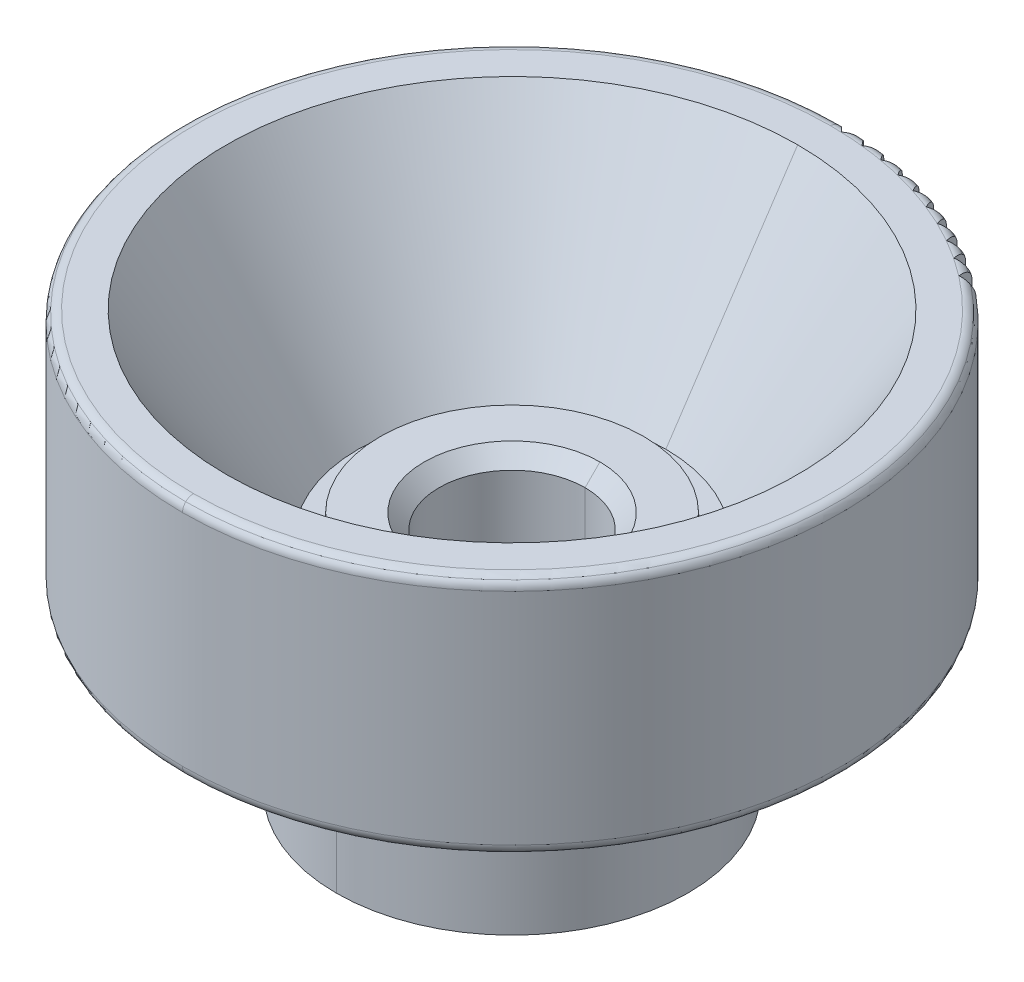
ISO-10303-21;
HEADER;
FILE_DESCRIPTION(('STEP AP214'),'2;1');
FILE_NAME('part.step','',(''),(''),'','','');
FILE_SCHEMA(('AUTOMOTIVE_DESIGN { 1 0 10303 214 1 1 1 1 }'));
ENDSEC;
DATA;
#1=APPLICATION_CONTEXT('core data for automotive mechanical design processes');
#2=APPLICATION_PROTOCOL_DEFINITION('international standard','automotive_design',2000,#1);
#3=PRODUCT_CONTEXT('',#1,'mechanical');
#4=PRODUCT('Part','Part','',(#3));
#5=PRODUCT_RELATED_PRODUCT_CATEGORY('part','',(#4));
#6=PRODUCT_DEFINITION_FORMATION('','',#4);
#7=PRODUCT_DEFINITION_CONTEXT('part definition',#1,'design');
#8=PRODUCT_DEFINITION('design','',#6,#7);
#9=PRODUCT_DEFINITION_SHAPE('','',#8);
#10=(LENGTH_UNIT() NAMED_UNIT(*) SI_UNIT(.MILLI.,.METRE.));
#11=(NAMED_UNIT(*) PLANE_ANGLE_UNIT() SI_UNIT($,.RADIAN.));
#12=(NAMED_UNIT(*) SI_UNIT($,.STERADIAN.) SOLID_ANGLE_UNIT());
#13=UNCERTAINTY_MEASURE_WITH_UNIT(LENGTH_MEASURE(1.E-05),#10,'distance_accuracy_value','');
#14=(GEOMETRIC_REPRESENTATION_CONTEXT(3) GLOBAL_UNCERTAINTY_ASSIGNED_CONTEXT((#13)) GLOBAL_UNIT_ASSIGNED_CONTEXT((#10,
#11,#12)) REPRESENTATION_CONTEXT('',''));
#15=CARTESIAN_POINT('',(0.,0.,0.));
#16=DIRECTION('',(0.,0.,1.));
#17=DIRECTION('',(1.,0.,0.));
#18=AXIS2_PLACEMENT_3D('',#15,#16,#17);
#19=CARTESIAN_POINT('',(0.,11.,0.));
#20=DIRECTION('',(0.,-1.,0.));
#21=DIRECTION('',(0.,0.,-1.));
#22=AXIS2_PLACEMENT_3D('',#19,#20,#21);
#23=CONICAL_SURFACE('',#22,6.043744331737,0.0872664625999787);
#24=DIRECTION('',(0.,-0.996194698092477,-0.087155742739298));
#25=VECTOR('',#24,1.);
#26=CARTESIAN_POINT('',(0.,11.5,-5.999999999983));
#27=LINE('',#26,#25);
#28=CARTESIAN_POINT('',(0.,11.5,-5.999999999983));
#29=VERTEX_POINT('',#28);
#30=CARTESIAN_POINT('',(0.,10.5,-6.0874886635));
#31=VERTEX_POINT('',#30);
#32=EDGE_CURVE('E3008',#29,#31,#27,.T.);
#33=ORIENTED_EDGE('',*,*,#32,.F.);
#34=CARTESIAN_POINT('',(0.,11.5,0.));
#35=DIRECTION('',(0.,1.,0.));
#36=DIRECTION('',(2.512064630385E-13,0.,1.));
#37=AXIS2_PLACEMENT_3D('',#34,#35,#36);
#38=CIRCLE('',#37,5.999999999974);
#39=CARTESIAN_POINT('',(5.029027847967E-13,11.5,5.999999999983));
#40=VERTEX_POINT('',#39);
#41=EDGE_CURVE('E3007',#40,#29,#38,.T.);
#42=ORIENTED_EDGE('',*,*,#41,.F.);
#43=DIRECTION('',(-5.00199044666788E-13,-0.996194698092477,0.087155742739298));
#44=VECTOR('',#43,1.);
#45=CARTESIAN_POINT('',(5.029027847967E-13,11.5,5.999999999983));
#46=LINE('',#45,#44);
#47=CARTESIAN_POINT('',(0.,10.5,6.0874886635));
#48=VERTEX_POINT('',#47);
#49=EDGE_CURVE('E3016',#40,#48,#46,.T.);
#50=ORIENTED_EDGE('',*,*,#49,.T.);
#51=CARTESIAN_POINT('',(0.,10.5,0.));
#52=DIRECTION('',(0.,-1.,0.));
#53=DIRECTION('',(0.,0.,-1.));
#54=AXIS2_PLACEMENT_3D('',#51,#52,#53);
#55=CIRCLE('',#54,6.0874886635);
#56=EDGE_CURVE('E11',#31,#48,#55,.T.);
#57=ORIENTED_EDGE('',*,*,#56,.F.);
#58=EDGE_LOOP('',(#33,#42,#50,#57));
#59=FACE_BOUND('',#58,.T.);
#60=ADVANCED_FACE('F16',(#59),#23,.T.);
#61=CARTESIAN_POINT('',(7.,10.5,0.));
#62=DIRECTION('',(0.,1.,0.));
#63=DIRECTION('',(1.,0.,0.));
#64=AXIS2_PLACEMENT_3D('',#61,#62,#63);
#65=PLANE('',#64);
#66=CARTESIAN_POINT('',(0.,10.5,0.));
#67=DIRECTION('',(0.,-1.,0.));
#68=DIRECTION('',(0.,0.,1.));
#69=AXIS2_PLACEMENT_3D('',#66,#67,#68);
#70=CIRCLE('',#69,6.0874886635);
#71=EDGE_CURVE('E3003',#48,#31,#70,.T.);
#72=ORIENTED_EDGE('',*,*,#71,.T.);
#73=ORIENTED_EDGE('',*,*,#56,.T.);
#74=EDGE_LOOP('',(#72,#73));
#75=FACE_BOUND('',#74,.T.);
#76=CARTESIAN_POINT('',(0.,10.5,0.));
#77=DIRECTION('',(0.,1.,0.));
#78=DIRECTION('',(0.,0.,1.));
#79=AXIS2_PLACEMENT_3D('',#76,#77,#78);
#80=CIRCLE('',#79,7.000000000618);
#81=CARTESIAN_POINT('',(0.,10.49999999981,7.000000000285));
#82=VERTEX_POINT('',#81);
#83=CARTESIAN_POINT('',(0.,10.49999999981,-7.000000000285));
#84=VERTEX_POINT('',#83);
#85=EDGE_CURVE('E3112',#82,#84,#80,.T.);
#86=ORIENTED_EDGE('',*,*,#85,.T.);
#87=CARTESIAN_POINT('',(0.,10.5,0.));
#88=DIRECTION('',(0.,1.,0.));
#89=DIRECTION('',(0.,0.,-1.));
#90=AXIS2_PLACEMENT_3D('',#87,#88,#89);
#91=CIRCLE('',#90,7.000000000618);
#92=EDGE_CURVE('E29',#84,#82,#91,.T.);
#93=ORIENTED_EDGE('',*,*,#92,.T.);
#94=EDGE_LOOP('',(#86,#93));
#95=FACE_BOUND('',#94,.T.);
#96=ADVANCED_FACE('F1684',(#75,#95),#65,.T.);
#97=CARTESIAN_POINT('',(0.,14.99999999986,0.));
#98=DIRECTION('',(0.,1.,0.));
#99=DIRECTION('',(0.,0.,1.));
#100=AXIS2_PLACEMENT_3D('',#97,#98,#99);
#101=CONICAL_SURFACE('',#100,10.00000000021,0.588002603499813);
#102=DIRECTION('',(0.,0.832050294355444,0.554700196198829));
#103=VECTOR('',#102,1.);
#104=CARTESIAN_POINT('',(0.,10.49999999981,7.000000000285));
#105=LINE('',#104,#103);
#106=CARTESIAN_POINT('',(0.,19.5,13.));
#107=VERTEX_POINT('',#106);
#108=EDGE_CURVE('E3093',#82,#107,#105,.T.);
#109=ORIENTED_EDGE('',*,*,#108,.F.);
#110=ORIENTED_EDGE('',*,*,#92,.F.);
#111=DIRECTION('',(0.,0.832050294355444,-0.554700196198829));
#112=VECTOR('',#111,1.);
#113=CARTESIAN_POINT('',(0.,10.49999999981,-7.000000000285));
#114=LINE('',#113,#112);
#115=CARTESIAN_POINT('',(0.,19.5,-13.));
#116=VERTEX_POINT('',#115);
#117=EDGE_CURVE('E3133',#84,#116,#114,.T.);
#118=ORIENTED_EDGE('',*,*,#117,.T.);
#119=CARTESIAN_POINT('',(0.,19.5,0.));
#120=DIRECTION('',(0.,-1.,0.));
#121=DIRECTION('',(0.,0.,1.));
#122=AXIS2_PLACEMENT_3D('',#119,#120,#121);
#123=CIRCLE('',#122,13.);
#124=EDGE_CURVE('E239',#107,#116,#123,.T.);
#125=ORIENTED_EDGE('',*,*,#124,.F.);
#126=EDGE_LOOP('',(#109,#110,#118,#125));
#127=FACE_BOUND('',#126,.T.);
#128=ADVANCED_FACE('F18',(#127),#101,.F.);
#129=CARTESIAN_POINT('',(14.5,19.5,0.));
#130=DIRECTION('',(0.,1.,0.));
#131=DIRECTION('',(1.,0.,0.));
#132=AXIS2_PLACEMENT_3D('',#129,#130,#131);
#133=PLANE('',#132);
#134=ORIENTED_EDGE('',*,*,#124,.T.);
#135=CARTESIAN_POINT('',(0.,19.5,0.));
#136=DIRECTION('',(0.,-1.,0.));
#137=DIRECTION('',(0.,0.,-1.));
#138=AXIS2_PLACEMENT_3D('',#135,#136,#137);
#139=CIRCLE('',#138,13.);
#140=EDGE_CURVE('E3088',#116,#107,#139,.T.);
#141=ORIENTED_EDGE('',*,*,#140,.T.);
#142=EDGE_LOOP('',(#134,#141));
#143=FACE_BOUND('',#142,.T.);
#144=CARTESIAN_POINT('',(0.,19.5,0.));
#145=DIRECTION('',(0.,1.,0.));
#146=DIRECTION('',(0.,0.,1.));
#147=AXIS2_PLACEMENT_3D('',#144,#145,#146);
#148=CIRCLE('',#147,14.5);
#149=CARTESIAN_POINT('',(0.,19.5,14.5));
#150=VERTEX_POINT('',#149);
#151=CARTESIAN_POINT('',(0.,19.5,-14.5));
#152=VERTEX_POINT('',#151);
#153=EDGE_CURVE('E231',#150,#152,#148,.T.);
#154=ORIENTED_EDGE('',*,*,#153,.T.);
#155=CARTESIAN_POINT('',(0.,19.5,0.));
#156=DIRECTION('',(0.,1.,0.));
#157=DIRECTION('',(0.,0.,-1.));
#158=AXIS2_PLACEMENT_3D('',#155,#156,#157);
#159=CIRCLE('',#158,14.5);
#160=EDGE_CURVE('E42',#152,#150,#159,.T.);
#161=ORIENTED_EDGE('',*,*,#160,.T.);
#162=EDGE_LOOP('',(#154,#161));
#163=FACE_BOUND('',#162,.T.);
#164=ADVANCED_FACE('F1683',(#143,#163),#133,.T.);
#165=CARTESIAN_POINT('',(0.,19.,0.));
#166=DIRECTION('',(0.,-1.,0.));
#167=DIRECTION('',(0.,0.,-1.));
#168=AXIS2_PLACEMENT_3D('',#165,#166,#167);
#169=TOROIDAL_SURFACE('',#168,14.5,0.5);
#170=CARTESIAN_POINT('',(0.,19.,-14.5));
#171=DIRECTION('',(-1.,0.,0.));
#172=DIRECTION('',(0.,1.,0.));
#173=AXIS2_PLACEMENT_3D('',#170,#171,#172);
#174=CIRCLE('',#173,0.5);
#175=CARTESIAN_POINT('',(0.,19.35355339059,-14.85355339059));
#176=VERTEX_POINT('',#175);
#177=EDGE_CURVE('E235',#152,#176,#174,.T.);
#178=ORIENTED_EDGE('',*,*,#177,.T.);
#179=CARTESIAN_POINT('',(0.,19.35355339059,0.));
#180=DIRECTION('',(0.,-1.,0.));
#181=DIRECTION('',(0.,0.,1.));
#182=AXIS2_PLACEMENT_3D('',#179,#180,#181);
#183=CIRCLE('',#182,14.85355339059);
#184=CARTESIAN_POINT('',(0.,19.35355339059,14.85355339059));
#185=VERTEX_POINT('',#184);
#186=EDGE_CURVE('E2751',#185,#176,#183,.T.);
#187=ORIENTED_EDGE('',*,*,#186,.F.);
#188=CARTESIAN_POINT('',(0.,19.,14.5));
#189=DIRECTION('',(1.,0.,0.));
#190=DIRECTION('',(0.,1.,0.));
#191=AXIS2_PLACEMENT_3D('',#188,#189,#190);
#192=CIRCLE('',#191,0.5);
#193=EDGE_CURVE('E234',#150,#185,#192,.T.);
#194=ORIENTED_EDGE('',*,*,#193,.F.);
#195=ORIENTED_EDGE('',*,*,#160,.F.);
#196=EDGE_LOOP('',(#178,#187,#194,#195));
#197=FACE_BOUND('',#196,.T.);
#198=ADVANCED_FACE('F1692',(#197),#169,.T.);
#199=CARTESIAN_POINT('',(0.,19.,0.));
#200=DIRECTION('',(0.,-1.,0.));
#201=DIRECTION('',(0.,0.,-1.));
#202=AXIS2_PLACEMENT_3D('',#199,#200,#201);
#203=TOROIDAL_SURFACE('',#202,14.5,0.5);
#204=CARTESIAN_POINT('',(0.148179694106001,19.35355339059,-14.852820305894));
#205=CARTESIAN_POINT('',(0.214011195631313,19.4187947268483,-14.7869888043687));
#206=CARTESIAN_POINT('',(0.302585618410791,19.4574765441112,-14.6984143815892));
#207=CARTESIAN_POINT('',(0.395293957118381,19.4979637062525,-14.6057060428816));
#208=CARTESIAN_POINT('',(0.500000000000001,19.49990749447,-14.501));
#209=B_SPLINE_CURVE_WITH_KNOTS('',2,(#204,#205,#206,#207,#208),.UNSPECIFIED.,.F.,.F.,(3,2,3),
(0.,0.5,1.),.UNSPECIFIED.);
#210=CARTESIAN_POINT('',(0.148173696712,19.35355339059,-14.8528143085));
#211=VERTEX_POINT('',#210);
#212=CARTESIAN_POINT('',(0.5,19.49990749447,-14.501));
#213=VERTEX_POINT('',#212);
#214=EDGE_CURVE('E2277',#211,#213,#209,.T.);
#215=ORIENTED_EDGE('',*,*,#214,.F.);
#216=CARTESIAN_POINT('',(0.,19.35355339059,0.));
#217=DIRECTION('',(0.,-1.,0.));
#218=DIRECTION('',(0.,0.,-1.));
#219=AXIS2_PLACEMENT_3D('',#216,#217,#218);
#220=CIRCLE('',#219,14.85355339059);
#221=EDGE_CURVE('E636',#176,#211,#220,.T.);
#222=ORIENTED_EDGE('',*,*,#221,.F.);
#223=ORIENTED_EDGE('',*,*,#177,.F.);
#224=ORIENTED_EDGE('',*,*,#153,.F.);
#225=ORIENTED_EDGE('',*,*,#193,.T.);
#226=CARTESIAN_POINT('',(0.,19.35355339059,0.));
#227=DIRECTION('',(0.,-1.,0.));
#228=DIRECTION('',(0.628294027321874,0.,-0.777975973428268));
#229=AXIS2_PLACEMENT_3D('',#226,#227,#228);
#230=CIRCLE('',#229,14.85355339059);
#231=CARTESIAN_POINT('',(9.332398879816,19.35355339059,-11.55570765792));
#232=VERTEX_POINT('',#231);
#233=EDGE_CURVE('E615',#232,#185,#230,.T.);
#234=ORIENTED_EDGE('',*,*,#233,.F.);
#235=CARTESIAN_POINT('',(8.837146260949,19.49990749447,-11.50799057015));
#236=CARTESIAN_POINT('',(9.12970150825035,19.4960493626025,-11.53618126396));
#237=CARTESIAN_POINT('',(9.33239834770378,19.35355339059,-11.5557131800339));
#238=B_SPLINE_CURVE_WITH_KNOTS('',2,(#235,#236,#237),.UNSPECIFIED.,.F.,.F.,(3,3),(0.,1.),.UNSPECIFIED.);
#239=CARTESIAN_POINT('',(8.837146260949,19.49990749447,-11.50799057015));
#240=VERTEX_POINT('',#239);
#241=EDGE_CURVE('E593',#240,#232,#238,.T.);
#242=ORIENTED_EDGE('',*,*,#241,.F.);
#243=CARTESIAN_POINT('',(8.75542409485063,19.35355339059,-11.9987823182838));
#244=CARTESIAN_POINT('',(8.77071586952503,19.4187953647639,-11.9069458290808));
#245=CARTESIAN_POINT('',(8.79128882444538,19.457474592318,-11.7833926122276));
#246=CARTESIAN_POINT('',(8.81282441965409,19.4979636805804,-11.654058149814));
#247=CARTESIAN_POINT('',(8.83714626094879,19.49990749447,-11.50799057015));
#248=B_SPLINE_CURVE_WITH_KNOTS('',2,(#243,#244,#245,#246,#247),.UNSPECIFIED.,.F.,.F.,(3,2,3),
(0.,0.5,1.),.UNSPECIFIED.);
#249=CARTESIAN_POINT('',(8.75541573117,19.35355339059,-11.99878092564));
#250=VERTEX_POINT('',#249);
#251=EDGE_CURVE('E557',#250,#240,#248,.T.);
#252=ORIENTED_EDGE('',*,*,#251,.F.);
#253=CARTESIAN_POINT('',(0.,19.35355339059,0.));
#254=DIRECTION('',(0.,-1.,0.));
#255=DIRECTION('',(0.573215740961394,0.,-0.819404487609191));
#256=AXIS2_PLACEMENT_3D('',#253,#254,#255);
#257=CIRCLE('',#256,14.85355339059);
#258=CARTESIAN_POINT('',(8.514290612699,19.35355339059,-12.17106830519));
#259=VERTEX_POINT('',#258);
#260=EDGE_CURVE('E639',#259,#250,#257,.T.);
#261=ORIENTED_EDGE('',*,*,#260,.F.);
#262=CARTESIAN_POINT('',(8.023500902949,19.49990749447,-12.08935210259));
#263=CARTESIAN_POINT('',(8.31341959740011,19.496049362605,-12.1376267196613));
#264=CARTESIAN_POINT('',(8.51428970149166,19.35355339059,-12.1710737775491));
#265=B_SPLINE_CURVE_WITH_KNOTS('',2,(#262,#263,#264),.UNSPECIFIED.,.F.,.F.,(3,3),(0.,1.),.UNSPECIFIED.);
#266=CARTESIAN_POINT('',(8.023500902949,19.49990749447,-12.08935210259));
#267=VERTEX_POINT('',#266);
#268=EDGE_CURVE('E674',#267,#259,#265,.T.);
#269=ORIENTED_EDGE('',*,*,#268,.F.);
#270=CARTESIAN_POINT('',(7.90816764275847,19.35355339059,-12.5733493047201));
#271=CARTESIAN_POINT('',(7.92974868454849,19.418795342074,-12.4827842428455));
#272=CARTESIAN_POINT('',(7.95878305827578,19.4574746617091,-12.3609411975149));
#273=CARTESIAN_POINT('',(7.98917587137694,19.497963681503,-12.2333974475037));
#274=CARTESIAN_POINT('',(8.02350090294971,19.49990749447,-12.0893521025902));
#275=B_SPLINE_CURVE_WITH_KNOTS('',2,(#270,#271,#272,#273,#274),.UNSPECIFIED.,.F.,.F.,(3,2,3),
(0.,0.5,1.),.UNSPECIFIED.);
#276=CARTESIAN_POINT('',(7.908159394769,19.35355339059,-12.57334733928));
#277=VERTEX_POINT('',#276);
#278=EDGE_CURVE('E769',#277,#267,#275,.T.);
#279=ORIENTED_EDGE('',*,*,#278,.F.);
#280=CARTESIAN_POINT('',(0.,19.35355339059,0.));
#281=DIRECTION('',(0.,-1.,0.));
#282=DIRECTION('',(0.515414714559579,0.,-0.856940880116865));
#283=AXIS2_PLACEMENT_3D('',#280,#281,#282);
#284=CIRCLE('',#283,14.85355339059);
#285=CARTESIAN_POINT('',(7.655739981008,19.35355339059,-12.7286171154));
#286=VERTEX_POINT('',#285);
#287=EDGE_CURVE('E646',#286,#277,#284,.T.);
#288=ORIENTED_EDGE('',*,*,#287,.F.);
#289=CARTESIAN_POINT('',(7.171744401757,19.49990749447,-12.61328994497));
#290=CARTESIAN_POINT('',(7.45764944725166,19.4960493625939,-12.6814191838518));
#291=CARTESIAN_POINT('',(7.65573869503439,19.35355339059,-12.7286225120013));
#292=B_SPLINE_CURVE_WITH_KNOTS('',2,(#289,#290,#291),.UNSPECIFIED.,.F.,.F.,(3,3),(0.,1.),.UNSPECIFIED.);
#293=CARTESIAN_POINT('',(7.171744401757,19.49990749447,-12.61328994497));
#294=VERTEX_POINT('',#293);
#295=EDGE_CURVE('E860',#294,#286,#292,.T.);
#296=ORIENTED_EDGE('',*,*,#295,.F.);
#297=CARTESIAN_POINT('',(7.02334787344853,19.35355339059,-13.0881936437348));
#298=CARTESIAN_POINT('',(7.0511156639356,19.4187953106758,-12.99933020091));
#299=CARTESIAN_POINT('',(7.08847362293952,19.457474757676,-12.8797759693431));
#300=CARTESIAN_POINT('',(7.12757923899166,19.4979636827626,-12.754628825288));
#301=CARTESIAN_POINT('',(7.17174440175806,19.49990749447,-12.6132899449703));
#302=B_SPLINE_CURVE_WITH_KNOTS('',2,(#297,#298,#299,#300,#301),.UNSPECIFIED.,.F.,.F.,(3,2,3),
(0.,0.5,1.),.UNSPECIFIED.);
#303=CARTESIAN_POINT('',(7.023339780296,19.35355339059,-13.08819111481));
#304=VERTEX_POINT('',#303);
#305=EDGE_CURVE('E2642',#304,#294,#302,.T.);
#306=ORIENTED_EDGE('',*,*,#305,.F.);
#307=CARTESIAN_POINT('',(0.,19.35355339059,0.));
#308=DIRECTION('',(0.,-1.,0.));
#309=DIRECTION('',(0.455165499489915,0.,-0.89040685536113));
#310=AXIS2_PLACEMENT_3D('',#307,#308,#309);
#311=CIRCLE('',#310,14.85355339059);
#312=CARTESIAN_POINT('',(6.760825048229,19.35355339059,-13.22570576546));
#313=VERTEX_POINT('',#312);
#314=EDGE_CURVE('E657',#313,#304,#311,.T.);
#315=ORIENTED_EDGE('',*,*,#314,.F.);
#316=CARTESIAN_POINT('',(6.285922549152,19.49990749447,-13.07731542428));
#317=CARTESIAN_POINT('',(6.56645591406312,19.4960493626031,-13.1649756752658));
#318=CARTESIAN_POINT('',(6.76082339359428,19.35355339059,-13.2257110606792));
#319=B_SPLINE_CURVE_WITH_KNOTS('',2,(#316,#317,#318),.UNSPECIFIED.,.F.,.F.,(3,3),(0.,1.),.UNSPECIFIED.);
#320=CARTESIAN_POINT('',(6.285922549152,19.49990749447,-13.07731542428));
#321=VERTEX_POINT('',#320);
#322=EDGE_CURVE('E2627',#321,#313,#319,.T.);
#323=ORIENTED_EDGE('',*,*,#322,.F.);
#324=CARTESIAN_POINT('',(6.10516762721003,19.35355339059,-13.5408698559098));
#325=CARTESIAN_POINT('',(6.1389902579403,19.4187952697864,-13.454130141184));
#326=CARTESIAN_POINT('',(6.18449445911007,19.4574748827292,-13.3374324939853));
#327=CARTESIAN_POINT('',(6.23212706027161,19.4979636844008,-13.2152764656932));
#328=CARTESIAN_POINT('',(6.28592254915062,19.49990749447,-13.0773154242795));
#329=B_SPLINE_CURVE_WITH_KNOTS('',2,(#324,#325,#326,#327,#328),.UNSPECIFIED.,.F.,.F.,(3,2,3),
(0.,0.5,1.),.UNSPECIFIED.);
#330=CARTESIAN_POINT('',(6.105159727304,19.35355339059,-13.54086677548));
#331=VERTEX_POINT('',#330);
#332=EDGE_CURVE('E2600',#331,#321,#329,.T.);
#333=ORIENTED_EDGE('',*,*,#332,.F.);
#334=CARTESIAN_POINT('',(0.,19.35355339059,0.));
#335=DIRECTION('',(0.,-1.,0.));
#336=DIRECTION('',(0.392754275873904,0.,-0.919643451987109));
#337=AXIS2_PLACEMENT_3D('',#334,#335,#336);
#338=CIRCLE('',#337,14.85355339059);
#339=CARTESIAN_POINT('',(5.833796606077,19.35355339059,-13.6599731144));
#340=VERTEX_POINT('',#339);
#341=EDGE_CURVE('E2404',#340,#331,#338,.T.);
#342=ORIENTED_EDGE('',*,*,#341,.F.);
#343=CARTESIAN_POINT('',(5.370242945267,19.49990749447,-13.4792244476));
#344=CARTESIAN_POINT('',(5.64407211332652,19.4960493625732,-13.5859993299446));
#345=CARTESIAN_POINT('',(5.83379459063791,19.35355339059,-13.6599782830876));
#346=B_SPLINE_CURVE_WITH_KNOTS('',2,(#343,#344,#345),.UNSPECIFIED.,.F.,.F.,(3,3),(0.,1.),.UNSPECIFIED.);
#347=CARTESIAN_POINT('',(5.370242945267,19.49990749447,-13.4792244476));
#348=VERTEX_POINT('',#347);
#349=EDGE_CURVE('E2586',#348,#340,#346,.T.);
#350=ORIENTED_EDGE('',*,*,#349,.F.);
#351=CARTESIAN_POINT('',(5.15798820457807,19.35355339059,-13.9292277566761));
#352=CARTESIAN_POINT('',(5.19770500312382,19.4187952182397,-13.8450237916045));
#353=CARTESIAN_POINT('',(5.25113943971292,19.4574750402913,-13.7317369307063));
#354=CARTESIAN_POINT('',(5.30707268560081,19.4979636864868,-13.613152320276));
#355=CARTESIAN_POINT('',(5.37024294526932,19.49990749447,-13.4792244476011));
#356=B_SPLINE_CURVE_WITH_KNOTS('',2,(#351,#352,#353,#354,#355),.UNSPECIFIED.,.F.,.F.,(3,2,3),
(0.,0.5,1.),.UNSPECIFIED.);
#357=CARTESIAN_POINT('',(5.157980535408,19.35355339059,-13.92922413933));
#358=VERTEX_POINT('',#357);
#359=EDGE_CURVE('E2557',#358,#348,#356,.T.);
#360=ORIENTED_EDGE('',*,*,#359,.F.);
#361=CARTESIAN_POINT('',(0.,19.35355339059,0.));
#362=DIRECTION('',(0.,-1.,0.));
#363=DIRECTION('',(0.328477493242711,0.,-0.94451179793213));
#364=AXIS2_PLACEMENT_3D('',#361,#362,#363);
#365=CIRCLE('',#364,14.85355339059);
#366=CARTESIAN_POINT('',(4.879057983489,19.35355339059,-14.02935641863));
#367=VERTEX_POINT('',#366);
#368=EDGE_CURVE('E1106',#367,#358,#365,.T.);
#369=ORIENTED_EDGE('',*,*,#368,.F.);
#370=CARTESIAN_POINT('',(4.429055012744,19.49990749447,-13.81710797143));
#371=CARTESIAN_POINT('',(4.69487931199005,19.4960493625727,-13.9424903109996));
#372=CARTESIAN_POINT('',(4.87905561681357,19.35355339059,-14.0293614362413));
#373=B_SPLINE_CURVE_WITH_KNOTS('',2,(#370,#371,#372),.UNSPECIFIED.,.F.,.F.,(3,3),(0.,1.),.UNSPECIFIED.);
#374=CARTESIAN_POINT('',(4.429055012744,19.49990749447,-13.81710797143));
#375=VERTEX_POINT('',#374);
#376=EDGE_CURVE('E2635',#375,#367,#373,.T.);
#377=ORIENTED_EDGE('',*,*,#376,.F.);
#378=CARTESIAN_POINT('',(4.18630865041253,19.35355339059,-14.2514226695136));
#379=CARTESIAN_POINT('',(4.23173094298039,19.418795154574,-14.170154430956));
#380=CARTESIAN_POINT('',(4.29284197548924,19.4574752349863,-14.0608163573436));
#381=CARTESIAN_POINT('',(4.35681007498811,19.4979636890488,-13.9463665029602));
#382=CARTESIAN_POINT('',(4.42905501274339,19.49990749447,-13.8171079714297));
#383=B_SPLINE_CURVE_WITH_KNOTS('',2,(#378,#379,#380,#381,#382),.UNSPECIFIED.,.F.,.F.,(3,2,3),
(0.,0.5,1.),.UNSPECIFIED.);
#384=CARTESIAN_POINT('',(4.186301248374,19.35355339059,-14.25141853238));
#385=VERTEX_POINT('',#384);
#386=EDGE_CURVE('E1099',#385,#375,#383,.T.);
#387=ORIENTED_EDGE('',*,*,#386,.F.);
#388=CARTESIAN_POINT('',(0.,19.35355339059,0.));
#389=DIRECTION('',(0.,-1.,0.));
#390=DIRECTION('',(0.2626404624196,0.,-0.964893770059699));
#391=AXIS2_PLACEMENT_3D('',#388,#389,#390);
#392=CIRCLE('',#391,14.85355339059);
#393=CARTESIAN_POINT('',(3.90114413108,19.35355339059,-14.33210112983));
#394=VERTEX_POINT('',#393);
#395=EDGE_CURVE('E2410',#394,#385,#392,.T.);
#396=ORIENTED_EDGE('',*,*,#395,.F.);
#397=CARTESIAN_POINT('',(3.466829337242,19.49990749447,-14.08936106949));
#398=CARTESIAN_POINT('',(3.7233861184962,19.4960493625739,-14.2327553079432));
#399=CARTESIAN_POINT('',(3.90114142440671,19.35355339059,-14.3321059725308));
#400=B_SPLINE_CURVE_WITH_KNOTS('',2,(#397,#398,#399),.UNSPECIFIED.,.F.,.F.,(3,3),(0.,1.),.UNSPECIFIED.);
#401=CARTESIAN_POINT('',(3.466829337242,19.49990749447,-14.08936106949));
#402=VERTEX_POINT('',#401);
#403=EDGE_CURVE('E2513',#402,#394,#400,.T.);
#404=ORIENTED_EDGE('',*,*,#403,.F.);
#405=CARTESIAN_POINT('',(3.19474438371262,19.35355339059,-14.5059241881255));
#406=CARTESIAN_POINT('',(3.24565639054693,19.4187950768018,-14.4279777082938));
#407=CARTESIAN_POINT('',(3.31415395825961,19.4574754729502,-14.3231076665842));
#408=CARTESIAN_POINT('',(3.3858529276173,19.4979636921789,-14.2133362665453));
#409=CARTESIAN_POINT('',(3.46682933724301,19.49990749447,-14.0893610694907));
#410=B_SPLINE_CURVE_WITH_KNOTS('',2,(#405,#406,#407,#408,#409),.UNSPECIFIED.,.F.,.F.,(3,2,3),
(0.,0.5,1.),.UNSPECIFIED.);
#411=CARTESIAN_POINT('',(3.194737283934,19.35355339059,-14.50591955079));
#412=VERTEX_POINT('',#411);
#413=EDGE_CURVE('E2484',#412,#402,#410,.T.);
#414=ORIENTED_EDGE('',*,*,#413,.F.);
#415=CARTESIAN_POINT('',(0.,19.35355339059,0.));
#416=DIRECTION('',(0.,-1.,0.));
#417=DIRECTION('',(0.195555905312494,0.,-0.980692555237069));
#418=AXIS2_PLACEMENT_3D('',#415,#416,#417);
#419=CIRCLE('',#418,14.85355339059);
#420=CARTESIAN_POINT('',(2.904700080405,19.35355339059,-14.56676922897));
#421=VERTEX_POINT('',#420);
#422=EDGE_CURVE('E2413',#421,#412,#419,.T.);
#423=ORIENTED_EDGE('',*,*,#422,.F.);
#424=CARTESIAN_POINT('',(2.488136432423,19.49990749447,-14.29469055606));
#425=CARTESIAN_POINT('',(2.7342070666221,19.4960493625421,-14.4554155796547));
#426=CARTESIAN_POINT('',(2.90469704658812,19.35355339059,-14.5667738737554));
#427=B_SPLINE_CURVE_WITH_KNOTS('',2,(#424,#425,#426),.UNSPECIFIED.,.F.,.F.,(3,3),(0.,1.),.UNSPECIFIED.);
#428=CARTESIAN_POINT('',(2.488136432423,19.49990749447,-14.29469055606));
#429=VERTEX_POINT('',#428);
#430=EDGE_CURVE('E2466',#429,#421,#427,.T.);
#431=ORIENTED_EDGE('',*,*,#430,.F.);
#432=CARTESIAN_POINT('',(2.18800527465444,19.35355339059,-14.6915234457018));
#433=CARTESIAN_POINT('',(2.24416513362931,19.4187949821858,-14.6172689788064));
#434=CARTESIAN_POINT('',(2.31972414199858,19.4574757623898,-14.5173649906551));
#435=CARTESIAN_POINT('',(2.39881324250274,19.4979636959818,-14.4127935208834));
#436=CARTESIAN_POINT('',(2.4881364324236,19.49990749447,-14.2946905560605));
#437=B_SPLINE_CURVE_WITH_KNOTS('',2,(#432,#433,#434,#435,#436),.UNSPECIFIED.,.F.,.F.,(3,2,3),
(0.,0.5,1.),.UNSPECIFIED.);
#438=CARTESIAN_POINT('',(2.187998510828,19.35355339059,-14.69151833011));
#439=VERTEX_POINT('',#438);
#440=EDGE_CURVE('E2451',#439,#429,#437,.T.);
#441=ORIENTED_EDGE('',*,*,#440,.F.);
#442=CARTESIAN_POINT('',(0.,19.35355339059,0.));
#443=DIRECTION('',(0.,-1.,0.));
#444=DIRECTION('',(0.127542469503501,0.,-0.991833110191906));
#445=AXIS2_PLACEMENT_3D('',#442,#443,#444);
#446=CIRCLE('',#445,14.85355339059);
#447=CARTESIAN_POINT('',(1.894458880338,19.35355339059,-14.73224605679));
#448=VERTEX_POINT('',#447);
#449=EDGE_CURVE('E2417',#448,#439,#446,.T.);
#450=ORIENTED_EDGE('',*,*,#449,.F.);
#451=CARTESIAN_POINT('',(1.497625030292,19.49990749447,-14.43212112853));
#452=CARTESIAN_POINT('',(1.73204069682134,19.4960493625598,-14.6094135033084));
#453=CARTESIAN_POINT('',(1.8944555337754,19.35355339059,-14.7322504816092));
#454=B_SPLINE_CURVE_WITH_KNOTS('',2,(#451,#452,#453),.UNSPECIFIED.,.F.,.F.,(3,3),(0.,1.),.UNSPECIFIED.);
#455=CARTESIAN_POINT('',(1.497625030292,19.49990749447,-14.43212112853));
#456=VERTEX_POINT('',#455);
#457=EDGE_CURVE('E417',#456,#448,#454,.T.);
#458=ORIENTED_EDGE('',*,*,#457,.F.);
#459=CARTESIAN_POINT('',(1.17087327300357,19.35355339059,-14.8073388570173));
#460=CARTESIAN_POINT('',(1.23201418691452,19.4187948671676,-14.7371291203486));
#461=CARTESIAN_POINT('',(1.31427606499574,19.4574761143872,-14.6426656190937));
#462=CARTESIAN_POINT('',(1.40037941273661,19.4979637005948,-14.5437908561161));
#463=CARTESIAN_POINT('',(1.49762503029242,19.49990749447,-14.4321211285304));
#464=B_SPLINE_CURVE_WITH_KNOTS('',2,(#459,#460,#461,#462,#463),.UNSPECIFIED.,.F.,.F.,(3,2,3),
(0.,0.5,1.),.UNSPECIFIED.);
#465=CARTESIAN_POINT('',(1.170866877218,19.35355339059,-14.80733328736));
#466=VERTEX_POINT('',#465);
#467=EDGE_CURVE('E414',#466,#456,#464,.T.);
#468=ORIENTED_EDGE('',*,*,#467,.F.);
#469=CARTESIAN_POINT('',(0.,19.35355339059,0.));
#470=DIRECTION('',(0.,-1.,0.));
#471=DIRECTION('',(0.0589232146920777,0.,-0.998262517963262));
#472=AXIS2_PLACEMENT_3D('',#469,#470,#471);
#473=CIRCLE('',#472,14.85355339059);
#474=CARTESIAN_POINT('',(0.8752191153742,19.35355339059,-14.8277456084));
#475=VERTEX_POINT('',#474);
#476=EDGE_CURVE('E415',#475,#466,#473,.T.);
#477=ORIENTED_EDGE('',*,*,#476,.F.);
#478=CARTESIAN_POINT('',(0.5,19.49990749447,-14.501));
#479=CARTESIAN_POINT('',(0.721647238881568,19.4960493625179,-14.6940175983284));
#480=CARTESIAN_POINT('',(0.87521547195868,19.35355339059,-14.8277497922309));
#481=B_SPLINE_CURVE_WITH_KNOTS('',2,(#478,#479,#480),.UNSPECIFIED.,.F.,.F.,(3,3),(0.,1.),.UNSPECIFIED.);
#482=EDGE_CURVE('E249',#213,#475,#481,.T.);
#483=ORIENTED_EDGE('',*,*,#482,.F.);
#484=EDGE_LOOP('',(#215,#222,#223,#224,#225,#234,#242,#252,#261,#269,#279,#288,#296,#306,#315,
#323,#333,#342,#350,#360,#369,#377,#387,#396,#404,#414,#423,#431,#441,#450,#458,#468,#477,#483));
#485=FACE_BOUND('',#484,.T.);
#486=ADVANCED_FACE('F266',(#485),#203,.T.);
#487=CARTESIAN_POINT('',(0.5,25.,-14.501));
#488=DIRECTION('',(-0.656722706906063,0.,-0.754132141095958));
#489=DIRECTION('',(-0.754132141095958,0.,0.656722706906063));
#490=AXIS2_PLACEMENT_3D('',#487,#488,#489);
#491=PLANE('',#490);
#492=DIRECTION('',(0.,1.,0.));
#493=VECTOR('',#492,1.);
#494=CARTESIAN_POINT('',(0.5,8.500092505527,-14.501));
#495=LINE('',#494,#493);
#496=CARTESIAN_POINT('',(0.5,8.500092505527,-14.501));
#497=VERTEX_POINT('',#496);
#498=EDGE_CURVE('E2272',#497,#213,#495,.T.);
#499=ORIENTED_EDGE('',*,*,#498,.T.);
#500=ORIENTED_EDGE('',*,*,#482,.T.);
#501=CARTESIAN_POINT('',(0.87521547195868,19.35355339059,-14.8277497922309));
#502=CARTESIAN_POINT('',(0.951814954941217,19.2823762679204,-14.8944551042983));
#503=CARTESIAN_POINT('',(0.993528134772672,19.1862937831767,-14.9307802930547));
#504=CARTESIAN_POINT('',(1.03271868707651,19.0960219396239,-14.9649086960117));
#505=CARTESIAN_POINT('',(1.03271868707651,19.00000000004,-14.9649086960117));
#506=B_SPLINE_CURVE_WITH_KNOTS('',2,(#501,#502,#503,#504,#505),.UNSPECIFIED.,.F.,.F.,(3,2,3),
(0.,0.5,1.),.UNSPECIFIED.);
#507=CARTESIAN_POINT('',(1.033183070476,19.00000000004,-14.96437543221));
#508=VERTEX_POINT('',#507);
#509=EDGE_CURVE('E300',#475,#508,#506,.T.);
#510=ORIENTED_EDGE('',*,*,#509,.T.);
#511=CARTESIAN_POINT('',(1.03271868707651,19.00000000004,-14.9649086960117));
#512=DIRECTION('',(1.7050163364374E-13,-1.,-1.48492329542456E-13));
#513=VECTOR('',#512,1.);
#514=LINE('',#511,#513);
#515=CARTESIAN_POINT('',(1.033183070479,8.999999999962,-14.96437543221));
#516=VERTEX_POINT('',#515);
#517=EDGE_CURVE('E339',#508,#516,#514,.T.);
#518=ORIENTED_EDGE('',*,*,#517,.T.);
#519=CARTESIAN_POINT('',(1.03271868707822,8.99999999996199,-14.9649086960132));
#520=CARTESIAN_POINT('',(1.03271868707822,8.90680665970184,-14.9649086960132));
#521=CARTESIAN_POINT('',(0.993436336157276,8.81361089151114,-14.9307003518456));
#522=CARTESIAN_POINT('',(0.953638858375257,8.71919300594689,-14.8960434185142));
#523=CARTESIAN_POINT('',(0.875204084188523,8.64644660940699,-14.8277398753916));
#524=B_SPLINE_CURVE_WITH_KNOTS('',2,(#519,#520,#521,#522,#523),.UNSPECIFIED.,.F.,.F.,(3,2,3),
(0.,0.5,1.),.UNSPECIFIED.);
#525=CARTESIAN_POINT('',(0.8751980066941,8.646446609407,-14.82774685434));
#526=VERTEX_POINT('',#525);
#527=EDGE_CURVE('E2306',#516,#526,#524,.T.);
#528=ORIENTED_EDGE('',*,*,#527,.T.);
#529=CARTESIAN_POINT('',(0.875204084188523,8.64644660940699,-14.8277398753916));
#530=CARTESIAN_POINT('',(0.805047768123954,8.58122015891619,-14.7666454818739));
#531=CARTESIAN_POINT('',(0.710538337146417,8.54252139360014,-14.6843436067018));
#532=CARTESIAN_POINT('',(0.611666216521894,8.50203623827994,-14.5982425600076));
#533=CARTESIAN_POINT('',(0.5,8.50009250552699,-14.501));
#534=B_SPLINE_CURVE_WITH_KNOTS('',2,(#529,#530,#531,#532,#533),.UNSPECIFIED.,.F.,.F.,(3,2,3),
(0.,0.5,1.),.UNSPECIFIED.);
#535=EDGE_CURVE('E212',#526,#497,#534,.T.);
#536=ORIENTED_EDGE('',*,*,#535,.T.);
#537=EDGE_LOOP('',(#499,#500,#510,#518,#528,#536));
#538=FACE_BOUND('',#537,.T.);
#539=ADVANCED_FACE('F256',(#538),#491,.T.);
#540=CARTESIAN_POINT('',(0.,9.,0.));
#541=DIRECTION('',(0.,-1.,0.));
#542=DIRECTION('',(0.,0.,-1.));
#543=AXIS2_PLACEMENT_3D('',#540,#541,#542);
#544=TOROIDAL_SURFACE('',#543,14.5,0.5);
#545=CARTESIAN_POINT('',(0.,9.,-14.5));
#546=DIRECTION('',(-1.,0.,0.));
#547=DIRECTION('',(0.,-0.707106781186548,-0.707106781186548));
#548=AXIS2_PLACEMENT_3D('',#545,#546,#547);
#549=CIRCLE('',#548,0.5);
#550=CARTESIAN_POINT('',(0.,8.646446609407,-14.85355339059));
#551=VERTEX_POINT('',#550);
#552=CARTESIAN_POINT('',(0.,8.5,-14.5));
#553=VERTEX_POINT('',#552);
#554=EDGE_CURVE('E205',#551,#553,#549,.T.);
#555=ORIENTED_EDGE('',*,*,#554,.F.);
#556=CARTESIAN_POINT('',(0.,8.646446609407,0.));
#557=DIRECTION('',(0.,-1.,0.));
#558=DIRECTION('',(0.,0.,-1.));
#559=AXIS2_PLACEMENT_3D('',#556,#557,#558);
#560=CIRCLE('',#559,14.85355339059);
#561=CARTESIAN_POINT('',(0.1481941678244,8.646446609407,-14.85281410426));
#562=VERTEX_POINT('',#561);
#563=EDGE_CURVE('E2303',#551,#562,#560,.T.);
#564=ORIENTED_EDGE('',*,*,#563,.T.);
#565=CARTESIAN_POINT('',(0.500000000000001,8.500092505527,-14.501));
#566=CARTESIAN_POINT('',(0.292174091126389,8.50395063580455,-14.7088259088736));
#567=CARTESIAN_POINT('',(0.1481900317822,8.646446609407,-14.8528099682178));
#568=B_SPLINE_CURVE_WITH_KNOTS('',2,(#565,#566,#567),.UNSPECIFIED.,.F.,.F.,(3,3),(0.,1.),.UNSPECIFIED.);
#569=EDGE_CURVE('E2266',#497,#562,#568,.T.);
#570=ORIENTED_EDGE('',*,*,#569,.F.);
#571=ORIENTED_EDGE('',*,*,#535,.F.);
#572=CARTESIAN_POINT('',(0.,8.646446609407,0.));
#573=DIRECTION('',(0.,-1.,0.));
#574=DIRECTION('',(0.0589217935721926,0.,-0.998262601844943));
#575=AXIS2_PLACEMENT_3D('',#572,#573,#574);
#576=CIRCLE('',#575,14.85355339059);
#577=CARTESIAN_POINT('',(1.170887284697,8.646446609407,-14.80733167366));
#578=VERTEX_POINT('',#577);
#579=EDGE_CURVE('E486',#526,#578,#576,.T.);
#580=ORIENTED_EDGE('',*,*,#579,.T.);
#581=CARTESIAN_POINT('',(1.49762503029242,8.500092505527,-14.4321211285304));
#582=CARTESIAN_POINT('',(1.30460751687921,8.50395063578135,-14.6537682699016));
#583=CARTESIAN_POINT('',(1.17088287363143,8.646446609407,-14.8073278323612));
#584=B_SPLINE_CURVE_WITH_KNOTS('',2,(#581,#582,#583),.UNSPECIFIED.,.F.,.F.,(3,3),(0.,1.),.UNSPECIFIED.);
#585=CARTESIAN_POINT('',(1.497625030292,8.500092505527,-14.43212112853));
#586=VERTEX_POINT('',#585);
#587=EDGE_CURVE('E422',#586,#578,#584,.T.);
#588=ORIENTED_EDGE('',*,*,#587,.F.);
#589=CARTESIAN_POINT('',(1.89444349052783,8.646446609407,-14.7322413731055));
#590=CARTESIAN_POINT('',(1.82024551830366,8.58122004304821,-14.6761242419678));
#591=CARTESIAN_POINT('',(1.72029295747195,8.54252174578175,-14.6005284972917));
#592=CARTESIAN_POINT('',(1.61572428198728,8.50203624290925,-14.5214415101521));
#593=CARTESIAN_POINT('',(1.497625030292,8.50009250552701,-14.43212112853));
#594=B_SPLINE_CURVE_WITH_KNOTS('',2,(#589,#590,#591,#592,#593),.UNSPECIFIED.,.F.,.F.,(3,2,3),
(0.,0.5,1.),.UNSPECIFIED.);
#595=CARTESIAN_POINT('',(1.89443790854,8.646446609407,-14.7322487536));
#596=VERTEX_POINT('',#595);
#597=EDGE_CURVE('E433',#596,#586,#594,.T.);
#598=ORIENTED_EDGE('',*,*,#597,.F.);
#599=CARTESIAN_POINT('',(0.,8.646446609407,0.));
#600=DIRECTION('',(0.,-1.,0.));
#601=DIRECTION('',(0.127541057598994,0.,-0.991833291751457));
#602=AXIS2_PLACEMENT_3D('',#599,#600,#601);
#603=CIRCLE('',#602,14.85355339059);
#604=CARTESIAN_POINT('',(2.188018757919,8.646446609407,-14.6915153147));
#605=VERTEX_POINT('',#604);
#606=EDGE_CURVE('E2314',#596,#605,#603,.T.);
#607=ORIENTED_EDGE('',*,*,#606,.T.);
#608=CARTESIAN_POINT('',(2.4881364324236,8.500092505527,-14.2946905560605));
#609=CARTESIAN_POINT('',(2.31084413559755,8.50395063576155,-14.5291061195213));
#610=CARTESIAN_POINT('',(2.18801409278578,8.646446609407,-14.691511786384));
#611=B_SPLINE_CURVE_WITH_KNOTS('',2,(#608,#609,#610),.UNSPECIFIED.,.F.,.F.,(3,3),(0.,1.),.UNSPECIFIED.);
#612=CARTESIAN_POINT('',(2.488136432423,8.500092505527,-14.29469055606));
#613=VERTEX_POINT('',#612);
#614=EDGE_CURVE('E473',#613,#605,#611,.T.);
#615=ORIENTED_EDGE('',*,*,#614,.F.);
#616=CARTESIAN_POINT('',(2.90468440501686,8.646446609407,-14.5667656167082));
#617=CARTESIAN_POINT('',(2.82679722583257,8.58121994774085,-14.515892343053));
#618=CARTESIAN_POINT('',(2.72187619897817,8.5425220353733,-14.4473614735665));
#619=CARTESIAN_POINT('',(2.61210773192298,8.50203624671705,-14.3756644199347));
#620=CARTESIAN_POINT('',(2.488136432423,8.500092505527,-14.29469055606));
#621=B_SPLINE_CURVE_WITH_KNOTS('',2,(#616,#617,#618,#619,#620),.UNSPECIFIED.,.F.,.F.,(3,2,3),
(0.,0.5,1.),.UNSPECIFIED.);
#622=CARTESIAN_POINT('',(2.904679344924,8.646446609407,-14.56677336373));
#623=VERTEX_POINT('',#622);
#624=EDGE_CURVE('E2457',#623,#613,#621,.T.);
#625=ORIENTED_EDGE('',*,*,#624,.F.);
#626=CARTESIAN_POINT('',(0.,8.646446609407,0.));
#627=DIRECTION('',(0.,-1.,0.));
#628=DIRECTION('',(0.195554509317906,0.,-0.980692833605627));
#629=AXIS2_PLACEMENT_3D('',#626,#627,#628);
#630=CIRCLE('',#629,14.85355339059);
#631=CARTESIAN_POINT('',(3.194757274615,8.646446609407,-14.50591514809));
#632=VERTEX_POINT('',#631);
#633=EDGE_CURVE('E2317',#623,#632,#630,.T.);
#634=ORIENTED_EDGE('',*,*,#633,.T.);
#635=CARTESIAN_POINT('',(3.46682933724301,8.500092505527,-14.0893610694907));
#636=CARTESIAN_POINT('',(3.30610438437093,8.50395063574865,-14.3354315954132));
#637=CARTESIAN_POINT('',(3.19475237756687,8.646446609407,-14.5059119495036));
#638=B_SPLINE_CURVE_WITH_KNOTS('',2,(#635,#636,#637),.UNSPECIFIED.,.F.,.F.,(3,3),(0.,1.),.UNSPECIFIED.);
#639=CARTESIAN_POINT('',(3.466829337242,8.500092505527,-14.08936106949));
#640=VERTEX_POINT('',#639);
#641=EDGE_CURVE('E2480',#640,#632,#638,.T.);
#642=ORIENTED_EDGE('',*,*,#641,.F.);
#643=CARTESIAN_POINT('',(3.90112824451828,8.64644660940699,-14.332098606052));
#644=CARTESIAN_POINT('',(3.81992183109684,8.58121986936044,-14.2867108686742));
#645=CARTESIAN_POINT('',(3.7105306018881,8.54252227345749,-14.2255701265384));
#646=CARTESIAN_POINT('',(3.59608380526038,8.50203624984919,-14.1616037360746));
#647=CARTESIAN_POINT('',(3.466829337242,8.50009250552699,-14.08936106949));
#648=B_SPLINE_CURVE_WITH_KNOTS('',2,(#643,#644,#645,#646,#647),.UNSPECIFIED.,.F.,.F.,(3,2,3),
(0.,0.5,1.),.UNSPECIFIED.);
#649=CARTESIAN_POINT('',(3.901123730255,8.646446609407,-14.33210668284));
#650=VERTEX_POINT('',#649);
#651=EDGE_CURVE('E2502',#650,#640,#648,.T.);
#652=ORIENTED_EDGE('',*,*,#651,.F.);
#653=CARTESIAN_POINT('',(0.,8.646446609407,0.));
#654=DIRECTION('',(0.,-1.,0.));
#655=DIRECTION('',(0.262639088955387,0.,-0.964894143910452));
#656=AXIS2_PLACEMENT_3D('',#653,#654,#655);
#657=CIRCLE('',#656,14.85355339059);
#658=CARTESIAN_POINT('',(4.186320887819,8.646446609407,-14.25141276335));
#659=VERTEX_POINT('',#658);
#660=EDGE_CURVE('E2323',#650,#659,#657,.T.);
#661=ORIENTED_EDGE('',*,*,#660,.T.);
#662=CARTESIAN_POINT('',(4.42905501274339,8.500092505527,-13.8171079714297));
#663=CARTESIAN_POINT('',(4.28566083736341,8.5039506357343,-14.0736646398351));
#664=CARTESIAN_POINT('',(4.18631578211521,8.646446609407,-14.2514099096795));
#665=B_SPLINE_CURVE_WITH_KNOTS('',2,(#662,#663,#664),.UNSPECIFIED.,.F.,.F.,(3,3),(0.,1.),.UNSPECIFIED.);
#666=CARTESIAN_POINT('',(4.429055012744,8.500092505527,-13.81710797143));
#667=VERTEX_POINT('',#666);
#668=EDGE_CURVE('E2671',#667,#659,#665,.T.);
#669=ORIENTED_EDGE('',*,*,#668,.F.);
#670=CARTESIAN_POINT('',(4.87904196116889,8.646446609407,-14.0293549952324));
#671=CARTESIAN_POINT('',(4.79490205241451,8.5812198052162,-13.9896684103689));
#672=CARTESIAN_POINT('',(4.68156011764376,8.5425224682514,-13.9362079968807));
#673=CARTESIAN_POINT('',(4.56297867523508,8.50203625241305,-13.8802762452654));
#674=CARTESIAN_POINT('',(4.429055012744,8.500092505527,-13.81710797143));
#675=B_SPLINE_CURVE_WITH_KNOTS('',2,(#670,#671,#672,#673,#674),.UNSPECIFIED.,.F.,.F.,(3,2,3),
(0.,0.5,1.),.UNSPECIFIED.);
#676=CARTESIAN_POINT('',(4.879038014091,8.646446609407,-14.02936336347));
#677=VERTEX_POINT('',#676);
#678=EDGE_CURVE('E2543',#677,#667,#675,.T.);
#679=ORIENTED_EDGE('',*,*,#678,.F.);
#680=CARTESIAN_POINT('',(0.,8.646446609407,0.));
#681=DIRECTION('',(0.,-1.,0.));
#682=DIRECTION('',(0.328476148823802,0.,-0.944512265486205));
#683=AXIS2_PLACEMENT_3D('',#680,#681,#682);
#684=CIRCLE('',#683,14.85355339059);
#685=CARTESIAN_POINT('',(5.157999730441,8.646446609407,-13.9292170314));
#686=VERTEX_POINT('',#685);
#687=EDGE_CURVE('E1117',#677,#686,#684,.T.);
#688=ORIENTED_EDGE('',*,*,#687,.T.);
#689=CARTESIAN_POINT('',(5.37024294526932,8.500092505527,-13.4792244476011));
#690=CARTESIAN_POINT('',(5.2448606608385,8.5039506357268,-13.7450486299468));
#691=CARTESIAN_POINT('',(5.15799444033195,8.646446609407,-13.9292145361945));
#692=B_SPLINE_CURVE_WITH_KNOTS('',2,(#689,#690,#691),.UNSPECIFIED.,.F.,.F.,(3,3),(0.,1.),.UNSPECIFIED.);
#693=CARTESIAN_POINT('',(5.370242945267,8.500092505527,-13.4792244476));
#694=VERTEX_POINT('',#693);
#695=EDGE_CURVE('E2552',#694,#686,#692,.T.);
#696=ORIENTED_EDGE('',*,*,#695,.F.);
#697=CARTESIAN_POINT('',(5.83378052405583,8.646446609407,-13.6599727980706));
#698=CARTESIAN_POINT('',(5.74710679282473,8.5812197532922,-13.626175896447));
#699=CARTESIAN_POINT('',(5.63035241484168,8.5425226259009,-13.5806495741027));
#700=CARTESIAN_POINT('',(5.50819964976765,8.50203625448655,-13.5330182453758));
#701=CARTESIAN_POINT('',(5.370242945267,8.500092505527,-13.4792244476));
#702=B_SPLINE_CURVE_WITH_KNOTS('',2,(#697,#698,#699,#700,#701),.UNSPECIFIED.,.F.,.F.,(3,2,3),
(0.,0.5,1.),.UNSPECIFIED.);
#703=CARTESIAN_POINT('',(5.833777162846,8.646446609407,-13.65998141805));
#704=VERTEX_POINT('',#703);
#705=EDGE_CURVE('E2580',#704,#694,#702,.T.);
#706=ORIENTED_EDGE('',*,*,#705,.F.);
#707=CARTESIAN_POINT('',(0.,8.646446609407,0.));
#708=DIRECTION('',(0.,-1.,0.));
#709=DIRECTION('',(0.392752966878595,0.,-0.919644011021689));
#710=AXIS2_PLACEMENT_3D('',#707,#708,#709);
#711=CIRCLE('',#710,14.85355339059);
#712=CARTESIAN_POINT('',(6.105178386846,8.646446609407,-13.54085836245));
#713=VERTEX_POINT('',#712);
#714=EDGE_CURVE('E2334',#704,#713,#711,.T.);
#715=ORIENTED_EDGE('',*,*,#714,.T.);
#716=CARTESIAN_POINT('',(6.28592254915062,8.500092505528,-13.0773154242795));
#717=CARTESIAN_POINT('',(6.17914771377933,8.5039506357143,-13.3511444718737));
#718=CARTESIAN_POINT('',(6.10517293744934,8.646446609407,-13.5408562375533));
#719=B_SPLINE_CURVE_WITH_KNOTS('',2,(#716,#717,#718),.UNSPECIFIED.,.F.,.F.,(3,3),(0.,1.),.UNSPECIFIED.);
#720=CARTESIAN_POINT('',(6.285922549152,8.500092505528,-13.07731542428));
#721=VERTEX_POINT('',#720);
#722=EDGE_CURVE('E2595',#721,#713,#719,.T.);
#723=ORIENTED_EDGE('',*,*,#722,.F.);
#724=CARTESIAN_POINT('',(6.76080898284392,8.646446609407,-13.2257065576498));
#725=CARTESIAN_POINT('',(6.67201313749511,8.5812197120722,-13.1979598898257));
#726=CARTESIAN_POINT('',(6.5524007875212,8.54252275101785,-13.1605837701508));
#727=CARTESIAN_POINT('',(6.42725698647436,8.5020362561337,-13.1214791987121));
#728=CARTESIAN_POINT('',(6.285922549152,8.500092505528,-13.07731542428));
#729=B_SPLINE_CURVE_WITH_KNOTS('',2,(#724,#725,#726,#727,#728),.UNSPECIFIED.,.F.,.F.,(3,2,3),
(0.,0.5,1.),.UNSPECIFIED.);
#730=CARTESIAN_POINT('',(6.760806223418,8.646446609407,-13.22571538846));
#731=VERTEX_POINT('',#730);
#732=EDGE_CURVE('E2608',#731,#721,#729,.T.);
#733=ORIENTED_EDGE('',*,*,#732,.F.);
#734=CARTESIAN_POINT('',(0.,8.646446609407,0.));
#735=DIRECTION('',(0.,-1.,0.));
#736=DIRECTION('',(0.455164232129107,0.,-0.890407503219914));
#737=AXIS2_PLACEMENT_3D('',#734,#735,#736);
#738=CIRCLE('',#737,14.85355339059);
#739=CARTESIAN_POINT('',(7.023357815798,8.646446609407,-13.08818143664));
#740=VERTEX_POINT('',#739);
#741=EDGE_CURVE('E2340',#731,#740,#738,.T.);
#742=ORIENTED_EDGE('',*,*,#741,.T.);
#743=CARTESIAN_POINT('',(7.17174440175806,8.500092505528,-12.6132899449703));
#744=CARTESIAN_POINT('',(7.08408418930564,8.50395063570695,-12.8938231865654));
#745=CARTESIAN_POINT('',(7.02335223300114,8.646446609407,-13.0881796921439));
#746=B_SPLINE_CURVE_WITH_KNOTS('',2,(#743,#744,#745),.UNSPECIFIED.,.F.,.F.,(3,3),(0.,1.),.UNSPECIFIED.);
#747=CARTESIAN_POINT('',(7.171744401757,8.500092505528,-12.61328994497));
#748=VERTEX_POINT('',#747);
#749=EDGE_CURVE('E2638',#748,#740,#746,.T.);
#750=ORIENTED_EDGE('',*,*,#749,.F.);
#751=CARTESIAN_POINT('',(7.65572400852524,8.64644660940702,-12.7286190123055));
#752=CARTESIAN_POINT('',(7.56522783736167,8.58121968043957,-12.7070543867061));
#753=CARTESIAN_POINT('',(7.44332556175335,8.54252284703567,-12.6780058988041));
#754=CARTESIAN_POINT('',(7.31578521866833,8.50203625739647,-12.6476138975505));
#755=CARTESIAN_POINT('',(7.171744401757,8.50009250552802,-12.61328994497));
#756=B_SPLINE_CURVE_WITH_KNOTS('',2,(#751,#752,#753,#754,#755),.UNSPECIFIED.,.F.,.F.,(3,2,3),
(0.,0.5,1.),.UNSPECIFIED.);
#757=CARTESIAN_POINT('',(7.655721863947,8.646446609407,-12.72862801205));
#758=VERTEX_POINT('',#757);
#759=EDGE_CURVE('E2656',#758,#748,#756,.T.);
#760=ORIENTED_EDGE('',*,*,#759,.F.);
#761=CARTESIAN_POINT('',(0.,8.646446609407,0.));
#762=DIRECTION('',(0.,-1.,0.));
#763=DIRECTION('',(0.515413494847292,0.,-0.856941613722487));
#764=AXIS2_PLACEMENT_3D('',#761,#762,#763);
#765=CIRCLE('',#764,14.85355339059);
#766=CARTESIAN_POINT('',(7.908176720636,8.646446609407,-12.57333644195));
#767=VERTEX_POINT('',#766);
#768=EDGE_CURVE('E2346',#758,#767,#765,.T.);
#769=ORIENTED_EDGE('',*,*,#768,.T.);
#770=CARTESIAN_POINT('',(8.02350090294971,8.500092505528,-12.0893521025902));
#771=CARTESIAN_POINT('',(7.95537169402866,8.5039506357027,-12.3752570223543));
#772=CARTESIAN_POINT('',(7.90817103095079,8.646446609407,-12.5733350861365));
#773=B_SPLINE_CURVE_WITH_KNOTS('',2,(#770,#771,#772),.UNSPECIFIED.,.F.,.F.,(3,3),(0.,1.),.UNSPECIFIED.);
#774=CARTESIAN_POINT('',(8.023500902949,8.500092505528,-12.08935210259));
#775=VERTEX_POINT('',#774);
#776=EDGE_CURVE('E936',#775,#767,#773,.T.);
#777=ORIENTED_EDGE('',*,*,#776,.F.);
#778=CARTESIAN_POINT('',(8.51427480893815,8.64644660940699,-12.1710712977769));
#779=CARTESIAN_POINT('',(8.42250817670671,8.58121965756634,-12.1557911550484));
#780=CARTESIAN_POINT('',(8.29889489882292,8.54252291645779,-12.1352081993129));
#781=CARTESIAN_POINT('',(8.16956389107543,8.50203625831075,-12.1136731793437));
#782=CARTESIAN_POINT('',(8.023500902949,8.500092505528,-12.08935210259));
#783=B_SPLINE_CURVE_WITH_KNOTS('',2,(#778,#779,#780,#781,#782),.UNSPECIFIED.,.F.,.F.,(3,2,3),
(0.,0.5,1.),.UNSPECIFIED.);
#784=CARTESIAN_POINT('',(8.514273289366,8.646446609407,-12.17108042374));
#785=VERTEX_POINT('',#784);
#786=EDGE_CURVE('E742',#785,#775,#783,.T.);
#787=ORIENTED_EDGE('',*,*,#786,.F.);
#788=CARTESIAN_POINT('',(0.,8.646446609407,0.));
#789=DIRECTION('',(0.,-1.,0.));
#790=DIRECTION('',(0.573214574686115,0.,-0.819405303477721));
#791=AXIS2_PLACEMENT_3D('',#788,#789,#790);
#792=CIRCLE('',#791,14.85355339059);
#793=CARTESIAN_POINT('',(8.755432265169,8.646446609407,-11.9987688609));
#794=VERTEX_POINT('',#793);
#795=EDGE_CURVE('E2352',#785,#794,#792,.T.);
#796=ORIENTED_EDGE('',*,*,#795,.T.);
#797=CARTESIAN_POINT('',(8.83714626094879,8.500092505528,-11.50799057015));
#798=CARTESIAN_POINT('',(8.78887166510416,8.5039506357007,-11.7979091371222));
#799=CARTESIAN_POINT('',(8.75542649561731,8.646446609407,-11.9987679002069));
#800=B_SPLINE_CURVE_WITH_KNOTS('',2,(#797,#798,#799),.UNSPECIFIED.,.F.,.F.,(3,3),(0.,1.),.UNSPECIFIED.);
#801=CARTESIAN_POINT('',(8.837146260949,8.500092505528,-11.50799057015));
#802=VERTEX_POINT('',#801);
#803=EDGE_CURVE('E556',#802,#794,#800,.T.);
#804=ORIENTED_EDGE('',*,*,#803,.F.);
#805=CARTESIAN_POINT('',(9.33238331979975,8.64644660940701,-11.5557117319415));
#806=CARTESIAN_POINT('',(9.2397821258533,8.58121964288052,-11.546788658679));
#807=CARTESIAN_POINT('',(9.115044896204,8.54252296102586,-11.5347689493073));
#808=CARTESIAN_POINT('',(8.98453760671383,8.50203625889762,-11.5221932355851));
#809=CARTESIAN_POINT('',(8.837146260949,8.50009250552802,-11.50799057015));
#810=B_SPLINE_CURVE_WITH_KNOTS('',2,(#805,#806,#807,#808,#809),.UNSPECIFIED.,.F.,.F.,(3,2,3),
(0.,0.5,1.),.UNSPECIFIED.);
#811=CARTESIAN_POINT('',(9.33238243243,8.646446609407,-11.55572094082));
#812=VERTEX_POINT('',#811);
#813=EDGE_CURVE('E527',#812,#802,#810,.T.);
#814=ORIENTED_EDGE('',*,*,#813,.F.);
#815=CARTESIAN_POINT('',(0.,8.646446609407,0.));
#816=DIRECTION('',(0.,-1.,0.));
#817=DIRECTION('',(0.628292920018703,0.,-0.777976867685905));
#818=AXIS2_PLACEMENT_3D('',#815,#816,#817);
#819=CIRCLE('',#818,14.85355339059);
#820=CARTESIAN_POINT('',(0.,8.646446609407,14.85355339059));
#821=VERTEX_POINT('',#820);
#822=EDGE_CURVE('E541',#812,#821,#819,.T.);
#823=ORIENTED_EDGE('',*,*,#822,.T.);
#824=CARTESIAN_POINT('',(0.,9.,14.5));
#825=DIRECTION('',(1.,0.,0.));
#826=DIRECTION('',(0.,-0.707106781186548,0.707106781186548));
#827=AXIS2_PLACEMENT_3D('',#824,#825,#826);
#828=CIRCLE('',#827,0.5);
#829=CARTESIAN_POINT('',(0.,8.5,14.5));
#830=VERTEX_POINT('',#829);
#831=EDGE_CURVE('E208',#821,#830,#828,.T.);
#832=ORIENTED_EDGE('',*,*,#831,.T.);
#833=CARTESIAN_POINT('',(0.,8.5,0.));
#834=DIRECTION('',(0.,-1.,0.));
#835=DIRECTION('',(0.,0.,-1.));
#836=AXIS2_PLACEMENT_3D('',#833,#834,#835);
#837=CIRCLE('',#836,14.5);
#838=EDGE_CURVE('E200',#553,#830,#837,.T.);
#839=ORIENTED_EDGE('',*,*,#838,.F.);
#840=EDGE_LOOP('',(#555,#564,#570,#571,#580,#588,#598,#607,#615,#625,#634,#642,#652,#661,#669,
#679,#688,#696,#706,#715,#723,#733,#742,#750,#760,#769,#777,#787,#796,#804,#814,#823,#832,#839));
#841=FACE_BOUND('',#840,.T.);
#842=ADVANCED_FACE('F202',(#841),#544,.T.);
#843=CARTESIAN_POINT('',(9.,8.5,0.));
#844=DIRECTION('',(0.,-1.,0.));
#845=DIRECTION('',(0.,0.,-1.));
#846=AXIS2_PLACEMENT_3D('',#843,#844,#845);
#847=PLANE('',#846);
#848=CARTESIAN_POINT('',(0.,8.5,0.));
#849=DIRECTION('',(0.,1.,0.));
#850=DIRECTION('',(0.,0.,1.));
#851=AXIS2_PLACEMENT_3D('',#848,#849,#850);
#852=CIRCLE('',#851,9.);
#853=CARTESIAN_POINT('',(0.,8.5,9.));
#854=VERTEX_POINT('',#853);
#855=CARTESIAN_POINT('',(0.,8.5,-9.));
#856=VERTEX_POINT('',#855);
#857=EDGE_CURVE('E2764',#854,#856,#852,.T.);
#858=ORIENTED_EDGE('',*,*,#857,.T.);
#859=CARTESIAN_POINT('',(0.,8.5,0.));
#860=DIRECTION('',(0.,1.,0.));
#861=DIRECTION('',(0.,0.,-1.));
#862=AXIS2_PLACEMENT_3D('',#859,#860,#861);
#863=CIRCLE('',#862,9.);
#864=EDGE_CURVE('E2768',#856,#854,#863,.T.);
#865=ORIENTED_EDGE('',*,*,#864,.T.);
#866=EDGE_LOOP('',(#858,#865));
#867=FACE_BOUND('',#866,.T.);
#868=CARTESIAN_POINT('',(0.,8.5,0.));
#869=DIRECTION('',(0.,-1.,0.));
#870=DIRECTION('',(0.,0.,1.));
#871=AXIS2_PLACEMENT_3D('',#868,#869,#870);
#872=CIRCLE('',#871,14.5);
#873=EDGE_CURVE('E213',#830,#553,#872,.T.);
#874=ORIENTED_EDGE('',*,*,#873,.T.);
#875=ORIENTED_EDGE('',*,*,#838,.T.);
#876=EDGE_LOOP('',(#874,#875));
#877=FACE_BOUND('',#876,.T.);
#878=ADVANCED_FACE('F215',(#867,#877),#847,.T.);
#879=CARTESIAN_POINT('',(0.,9.,0.));
#880=DIRECTION('',(0.,-1.,0.));
#881=DIRECTION('',(0.,0.,-1.));
#882=AXIS2_PLACEMENT_3D('',#879,#880,#881);
#883=TOROIDAL_SURFACE('',#882,14.5,0.5);
#884=ORIENTED_EDGE('',*,*,#831,.F.);
#885=CARTESIAN_POINT('',(0.,8.646446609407,0.));
#886=DIRECTION('',(0.,-1.,0.));
#887=DIRECTION('',(0.,0.,1.));
#888=AXIS2_PLACEMENT_3D('',#885,#886,#887);
#889=CIRCLE('',#888,14.85355339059);
#890=EDGE_CURVE('E221',#821,#551,#889,.T.);
#891=ORIENTED_EDGE('',*,*,#890,.T.);
#892=ORIENTED_EDGE('',*,*,#554,.T.);
#893=ORIENTED_EDGE('',*,*,#873,.F.);
#894=EDGE_LOOP('',(#884,#891,#892,#893));
#895=FACE_BOUND('',#894,.T.);
#896=ADVANCED_FACE('F219',(#895),#883,.T.);
#897=CARTESIAN_POINT('',(0.,9.,0.));
#898=DIRECTION('',(0.,-1.,0.));
#899=DIRECTION('',(0.,0.,-1.));
#900=AXIS2_PLACEMENT_3D('',#897,#898,#899);
#901=TOROIDAL_SURFACE('',#900,14.5,0.5);
#902=CARTESIAN_POINT('',(0.,9.,-14.5));
#903=DIRECTION('',(-1.,0.,0.));
#904=DIRECTION('',(0.,0.,-1.));
#905=AXIS2_PLACEMENT_3D('',#902,#903,#904);
#906=CIRCLE('',#905,0.5);
#907=CARTESIAN_POINT('',(0.0006250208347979,9.,-14.99999998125));
#908=VERTEX_POINT('',#907);
#909=EDGE_CURVE('E2300',#908,#551,#906,.T.);
#910=ORIENTED_EDGE('',*,*,#909,.T.);
#911=ORIENTED_EDGE('',*,*,#890,.F.);
#912=CARTESIAN_POINT('',(0.,9.,14.5));
#913=DIRECTION('',(1.,0.,0.));
#914=DIRECTION('',(0.,0.,1.));
#915=AXIS2_PLACEMENT_3D('',#912,#913,#914);
#916=CIRCLE('',#915,0.5);
#917=CARTESIAN_POINT('',(0.,9.,15.));
#918=VERTEX_POINT('',#917);
#919=EDGE_CURVE('E550',#918,#821,#916,.T.);
#920=ORIENTED_EDGE('',*,*,#919,.F.);
#921=CARTESIAN_POINT('',(0.,9.,0.));
#922=DIRECTION('',(0.,-1.,0.));
#923=DIRECTION('',(0.,0.,1.));
#924=AXIS2_PLACEMENT_3D('',#921,#922,#923);
#925=CIRCLE('',#924,15.);
#926=EDGE_CURVE('E2261',#918,#908,#925,.T.);
#927=ORIENTED_EDGE('',*,*,#926,.T.);
#928=EDGE_LOOP('',(#910,#911,#920,#927));
#929=FACE_BOUND('',#928,.T.);
#930=ADVANCED_FACE('F1731',(#929),#901,.T.);
#931=CARTESIAN_POINT('',(0.,0.,0.));
#932=DIRECTION('',(0.,1.,0.));
#933=DIRECTION('',(0.,0.,-1.));
#934=AXIS2_PLACEMENT_3D('',#931,#932,#933);
#935=CYLINDRICAL_SURFACE('',#934,15.);
#936=CARTESIAN_POINT('',(0.,9.,0.));
#937=DIRECTION('',(0.,-1.,0.));
#938=DIRECTION('',(0.635972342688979,0.,-0.771711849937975));
#939=AXIS2_PLACEMENT_3D('',#936,#937,#938);
#940=CIRCLE('',#939,15.);
#941=CARTESIAN_POINT('',(9.539585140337,8.999999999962,-11.57567774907));
#942=VERTEX_POINT('',#941);
#943=EDGE_CURVE('E578',#942,#918,#940,.T.);
#944=ORIENTED_EDGE('',*,*,#943,.F.);
#945=DIRECTION('',(-2.748024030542E-13,1.,-2.264854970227E-13));
#946=VECTOR('',#945,1.);
#947=CARTESIAN_POINT('',(9.539585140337,8.999999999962,-11.57567774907));
#948=LINE('',#947,#946);
#949=CARTESIAN_POINT('',(9.539585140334,19.,-11.57567774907));
#950=VERTEX_POINT('',#949);
#951=EDGE_CURVE('E589',#942,#950,#948,.T.);
#952=ORIENTED_EDGE('',*,*,#951,.T.);
#953=CARTESIAN_POINT('',(0.,19.,0.));
#954=DIRECTION('',(0.,1.,0.));
#955=DIRECTION('',(0.,0.,1.));
#956=AXIS2_PLACEMENT_3D('',#953,#954,#955);
#957=CIRCLE('',#956,15.);
#958=CARTESIAN_POINT('',(0.,19.,15.));
#959=VERTEX_POINT('',#958);
#960=EDGE_CURVE('E623',#959,#950,#957,.T.);
#961=ORIENTED_EDGE('',*,*,#960,.F.);
#962=CARTESIAN_POINT('',(0.,19.,0.));
#963=DIRECTION('',(0.,1.,0.));
#964=DIRECTION('',(6.6668889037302E-05,0.,-0.99999999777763));
#965=AXIS2_PLACEMENT_3D('',#962,#963,#964);
#966=CIRCLE('',#965,15.);
#967=CARTESIAN_POINT('',(0.0006250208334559,19.00000000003,-14.99999998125));
#968=VERTEX_POINT('',#967);
#969=EDGE_CURVE('E2738',#968,#959,#966,.T.);
#970=ORIENTED_EDGE('',*,*,#969,.F.);
#971=CARTESIAN_POINT('',(0.000625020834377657,19.00000000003,-14.9999999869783));
#972=DIRECTION('',(0.,-1.,0.));
#973=VECTOR('',#972,1.);
#974=LINE('',#971,#973);
#975=EDGE_CURVE('E549',#968,#908,#974,.T.);
#976=ORIENTED_EDGE('',*,*,#975,.T.);
#977=ORIENTED_EDGE('',*,*,#926,.F.);
#978=EDGE_LOOP('',(#944,#952,#961,#970,#976,#977));
#979=FACE_BOUND('',#978,.T.);
#980=ADVANCED_FACE('F1740',(#979),#935,.T.);
#981=CARTESIAN_POINT('',(0.,25.,-15.001));
#982=DIRECTION('',(0.707106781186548,0.,-0.707106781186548));
#983=DIRECTION('',(0.,-1.,0.));
#984=AXIS2_PLACEMENT_3D('',#981,#982,#983);
#985=PLANE('',#984);
#986=ORIENTED_EDGE('',*,*,#975,.F.);
#987=CARTESIAN_POINT('',(0.000812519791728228,19.00000000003,-15.0001874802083));
#988=CARTESIAN_POINT('',(0.000812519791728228,19.0941534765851,-15.0001874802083));
#989=CARTESIAN_POINT('',(0.0373328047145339,19.1863890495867,-14.9636671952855));
#990=CARTESIAN_POINT('',(0.0747572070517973,19.2809080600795,-14.9262427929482));
#991=CARTESIAN_POINT('',(0.148179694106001,19.35355339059,-14.852820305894));
#992=B_SPLINE_CURVE_WITH_KNOTS('',2,(#987,#988,#989,#990,#991),.UNSPECIFIED.,.F.,.F.,(3,2,3),
(0.,0.5,1.),.UNSPECIFIED.);
#993=EDGE_CURVE('E2382',#968,#211,#992,.T.);
#994=ORIENTED_EDGE('',*,*,#993,.T.);
#995=ORIENTED_EDGE('',*,*,#214,.T.);
#996=ORIENTED_EDGE('',*,*,#498,.F.);
#997=ORIENTED_EDGE('',*,*,#569,.T.);
#998=CARTESIAN_POINT('',(0.1481900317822,8.646446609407,-14.8528099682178));
#999=CARTESIAN_POINT('',(0.0764842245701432,8.71748344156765,-14.9245157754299));
#1000=CARTESIAN_POINT('',(0.0372467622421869,8.81370621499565,-14.9637532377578));
#1001=CARTESIAN_POINT('',(0.000812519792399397,8.90305459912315,-15.0001874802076));
#1002=CARTESIAN_POINT('',(0.000812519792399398,9.,-15.0001874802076));
#1003=B_SPLINE_CURVE_WITH_KNOTS('',2,(#998,#999,#1000,#1001,#1002),.UNSPECIFIED.,.F.,.F.,(3,2,
3),(0.,0.5,1.),.UNSPECIFIED.);
#1004=EDGE_CURVE('E586',#562,#908,#1003,.T.);
#1005=ORIENTED_EDGE('',*,*,#1004,.T.);
#1006=EDGE_LOOP('',(#986,#994,#995,#996,#997,#1005));
#1007=FACE_BOUND('',#1006,.T.);
#1008=ADVANCED_FACE('F1736',(#1007),#985,.T.);
#1009=CARTESIAN_POINT('',(0.,9.,0.));
#1010=DIRECTION('',(0.,-1.,0.));
#1011=DIRECTION('',(0.,0.,-1.));
#1012=AXIS2_PLACEMENT_3D('',#1009,#1010,#1011);
#1013=TOROIDAL_SURFACE('',#1012,14.5,0.5);
#1014=ORIENTED_EDGE('',*,*,#943,.T.);
#1015=ORIENTED_EDGE('',*,*,#919,.T.);
#1016=ORIENTED_EDGE('',*,*,#822,.F.);
#1017=CARTESIAN_POINT('',(9.53958514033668,8.99999999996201,-11.5756777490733));
#1018=CARTESIAN_POINT('',(9.53958514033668,8.90527189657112,-11.5756777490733));
#1019=CARTESIAN_POINT('',(9.48843954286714,8.81361067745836,-11.570749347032));
#1020=CARTESIAN_POINT('',(9.43565610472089,8.71901418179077,-11.5656631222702));
#1021=CARTESIAN_POINT('',(9.33238331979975,8.64644660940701,-11.5557117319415));
#1022=B_SPLINE_CURVE_WITH_KNOTS('',2,(#1017,#1018,#1019,#1020,#1021),.UNSPECIFIED.,.F.,.F.,(3,2,
3),(0.,0.5,1.),.UNSPECIFIED.);
#1023=EDGE_CURVE('E563',#942,#812,#1022,.T.);
#1024=ORIENTED_EDGE('',*,*,#1023,.F.);
#1025=EDGE_LOOP('',(#1014,#1015,#1016,#1024));
#1026=FACE_BOUND('',#1025,.T.);
#1027=ADVANCED_FACE('F507',(#1026),#1013,.T.);
#1028=CARTESIAN_POINT('',(0.,9.,0.));
#1029=DIRECTION('',(0.,-1.,0.));
#1030=DIRECTION('',(0.,0.,-1.));
#1031=AXIS2_PLACEMENT_3D('',#1028,#1029,#1030);
#1032=TOROIDAL_SURFACE('',#1031,14.5,0.5);
#1033=ORIENTED_EDGE('',*,*,#563,.F.);
#1034=ORIENTED_EDGE('',*,*,#909,.F.);
#1035=ORIENTED_EDGE('',*,*,#1004,.F.);
#1036=EDGE_LOOP('',(#1033,#1034,#1035));
#1037=FACE_BOUND('',#1036,.T.);
#1038=ADVANCED_FACE('F503',(#1037),#1032,.T.);
#1039=CARTESIAN_POINT('',(0.,9.,0.));
#1040=DIRECTION('',(0.,-1.,0.));
#1041=DIRECTION('',(0.,0.,-1.));
#1042=AXIS2_PLACEMENT_3D('',#1039,#1040,#1041);
#1043=TOROIDAL_SURFACE('',#1042,14.5,0.5);
#1044=CARTESIAN_POINT('',(1.17088287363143,8.646446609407,-14.8073278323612));
#1045=CARTESIAN_POINT('',(1.10418015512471,8.71759667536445,-14.883924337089));
#1046=CARTESIAN_POINT('',(1.06784473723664,8.81370621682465,-14.9256492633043));
#1047=CARTESIAN_POINT('',(1.03371633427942,8.9039780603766,-14.9648398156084));
#1048=CARTESIAN_POINT('',(1.03371633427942,8.999999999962,-14.9648398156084));
#1049=B_SPLINE_CURVE_WITH_KNOTS('',2,(#1044,#1045,#1046,#1047,#1048),.UNSPECIFIED.,.F.,.F.,(3,2,
3),(0.,0.5,1.),.UNSPECIFIED.);
#1050=EDGE_CURVE('E429',#578,#516,#1049,.T.);
#1051=ORIENTED_EDGE('',*,*,#1050,.F.);
#1052=ORIENTED_EDGE('',*,*,#579,.F.);
#1053=ORIENTED_EDGE('',*,*,#527,.F.);
#1054=EDGE_LOOP('',(#1051,#1052,#1053));
#1055=FACE_BOUND('',#1054,.T.);
#1056=ADVANCED_FACE('F492',(#1055),#1043,.T.);
#1057=CARTESIAN_POINT('',(0.,9.,0.));
#1058=DIRECTION('',(0.,-1.,0.));
#1059=DIRECTION('',(0.,0.,-1.));
#1060=AXIS2_PLACEMENT_3D('',#1057,#1058,#1059);
#1061=TOROIDAL_SURFACE('',#1060,14.5,0.5);
#1062=CARTESIAN_POINT('',(2.18801409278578,8.646446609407,-14.691511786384));
#1063=CARTESIAN_POINT('',(2.12674567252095,8.7175966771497,-14.7725207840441));
#1064=CARTESIAN_POINT('',(2.09337051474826,8.81370621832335,-14.8166493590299));
#1065=CARTESIAN_POINT('',(2.06202256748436,8.90397805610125,-14.8580975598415));
#1066=CARTESIAN_POINT('',(2.06202256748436,8.999999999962,-14.8580975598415));
#1067=B_SPLINE_CURVE_WITH_KNOTS('',2,(#1062,#1063,#1064,#1065,#1066),.UNSPECIFIED.,.F.,.F.,(3,2,
3),(0.,0.5,1.),.UNSPECIFIED.);
#1068=CARTESIAN_POINT('',(2.061458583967,8.999999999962,-14.85767100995));
#1069=VERTEX_POINT('',#1068);
#1070=EDGE_CURVE('E467',#605,#1069,#1067,.T.);
#1071=ORIENTED_EDGE('',*,*,#1070,.F.);
#1072=ORIENTED_EDGE('',*,*,#606,.F.);
#1073=CARTESIAN_POINT('',(2.0610320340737,8.999999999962,-14.8582349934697));
#1074=CARTESIAN_POINT('',(2.0610320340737,8.90680665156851,-14.8582349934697));
#1075=CARTESIAN_POINT('',(2.01948671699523,8.8136108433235,-14.8268135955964));
#1076=CARTESIAN_POINT('',(1.97739663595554,8.7191930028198,-14.7949801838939));
#1077=CARTESIAN_POINT('',(1.89444349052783,8.646446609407,-14.7322413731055));
#1078=B_SPLINE_CURVE_WITH_KNOTS('',2,(#1073,#1074,#1075,#1076,#1077),.UNSPECIFIED.,.F.,.F.,(3,2,
3),(0.,0.5,1.),.UNSPECIFIED.);
#1079=EDGE_CURVE('E438',#1069,#596,#1078,.T.);
#1080=ORIENTED_EDGE('',*,*,#1079,.F.);
#1081=EDGE_LOOP('',(#1071,#1072,#1080));
#1082=FACE_BOUND('',#1081,.T.);
#1083=ADVANCED_FACE('F502',(#1082),#1061,.T.);
#1084=CARTESIAN_POINT('',(0.,9.,0.));
#1085=DIRECTION('',(0.,-1.,0.));
#1086=DIRECTION('',(0.,0.,-1.));
#1087=AXIS2_PLACEMENT_3D('',#1084,#1085,#1086);
#1088=TOROIDAL_SURFACE('',#1087,14.5,0.5);
#1089=CARTESIAN_POINT('',(3.19475237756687,8.646446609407,-14.5059119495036));
#1090=CARTESIAN_POINT('',(3.13920927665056,8.71759667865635,-14.590948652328));
#1091=CARTESIAN_POINT('',(3.10895290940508,8.81370621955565,-14.6372712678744));
#1092=CARTESIAN_POINT('',(3.08053431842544,8.903978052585,-14.6807802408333));
#1093=CARTESIAN_POINT('',(3.08053431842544,8.999999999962,-14.6807802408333));
#1094=B_SPLINE_CURVE_WITH_KNOTS('',2,(#1089,#1090,#1091,#1092,#1093),.UNSPECIFIED.,.F.,.F.,(3,2,
3),(0.,0.5,1.),.UNSPECIFIED.);
#1095=CARTESIAN_POINT('',(3.079942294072,8.999999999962,-14.68039355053));
#1096=VERTEX_POINT('',#1095);
#1097=EDGE_CURVE('E2476',#632,#1096,#1094,.T.);
#1098=ORIENTED_EDGE('',*,*,#1097,.F.);
#1099=ORIENTED_EDGE('',*,*,#633,.F.);
#1100=CARTESIAN_POINT('',(3.07955560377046,8.999999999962,-14.6809855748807));
#1101=CARTESIAN_POINT('',(3.07955560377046,8.90680664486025,-14.6809855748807));
#1102=CARTESIAN_POINT('',(3.03594466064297,8.81361080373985,-14.6525003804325));
#1103=CARTESIAN_POINT('',(2.99176190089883,8.7191930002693,-14.6236416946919));
#1104=CARTESIAN_POINT('',(2.90468440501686,8.646446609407,-14.5667656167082));
#1105=B_SPLINE_CURVE_WITH_KNOTS('',2,(#1100,#1101,#1102,#1103,#1104),.UNSPECIFIED.,.F.,.F.,(3,2,
3),(0.,0.5,1.),.UNSPECIFIED.);
#1106=EDGE_CURVE('E2454',#1096,#623,#1105,.T.);
#1107=ORIENTED_EDGE('',*,*,#1106,.F.);
#1108=EDGE_LOOP('',(#1098,#1099,#1107));
#1109=FACE_BOUND('',#1108,.T.);
#1110=ADVANCED_FACE('F1759',(#1109),#1088,.T.);
#1111=CARTESIAN_POINT('',(0.,9.,0.));
#1112=DIRECTION('',(0.,-1.,0.));
#1113=DIRECTION('',(0.,0.,-1.));
#1114=AXIS2_PLACEMENT_3D('',#1111,#1112,#1113);
#1115=TOROIDAL_SURFACE('',#1114,14.5,0.5);
#1116=CARTESIAN_POINT('',(4.18631578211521,8.646446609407,-14.2514099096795));
#1117=CARTESIAN_POINT('',(4.1367618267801,8.71759667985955,-14.3400703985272));
#1118=CARTESIAN_POINT('',(4.10976796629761,8.81370622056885,-14.3883670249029));
#1119=CARTESIAN_POINT('',(4.08441371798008,8.9039780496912,-14.433730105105));
#1120=CARTESIAN_POINT('',(4.08441371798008,8.999999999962,-14.433730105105));
#1121=B_SPLINE_CURVE_WITH_KNOTS('',2,(#1116,#1117,#1118,#1119,#1120),.UNSPECIFIED.,.F.,.F.,(3,2,
3),(0.,0.5,1.),.UNSPECIFIED.);
#1122=CARTESIAN_POINT('',(4.083796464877,8.999999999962,-14.43338511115));
#1123=VERTEX_POINT('',#1122);
#1124=EDGE_CURVE('E2530',#659,#1123,#1121,.T.);
#1125=ORIENTED_EDGE('',*,*,#1124,.F.);
#1126=ORIENTED_EDGE('',*,*,#660,.F.);
#1127=CARTESIAN_POINT('',(4.08345147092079,8.99999999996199,-14.4340023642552));
#1128=CARTESIAN_POINT('',(4.08345147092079,8.90680663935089,-14.4340023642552));
#1129=CARTESIAN_POINT('',(4.03798205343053,8.81361077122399,-14.4085886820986));
#1130=CARTESIAN_POINT('',(3.99191647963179,8.71919299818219,-14.3828417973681));
#1131=CARTESIAN_POINT('',(3.90112824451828,8.64644660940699,-14.332098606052));
#1132=B_SPLINE_CURVE_WITH_KNOTS('',2,(#1127,#1128,#1129,#1130,#1131),.UNSPECIFIED.,.F.,.F.,(3,2,
3),(0.,0.5,1.),.UNSPECIFIED.);
#1133=EDGE_CURVE('E2498',#1123,#650,#1132,.T.);
#1134=ORIENTED_EDGE('',*,*,#1133,.F.);
#1135=EDGE_LOOP('',(#1125,#1126,#1134));
#1136=FACE_BOUND('',#1135,.T.);
#1137=ADVANCED_FACE('F1764',(#1136),#1115,.T.);
#1138=CARTESIAN_POINT('',(0.,9.,0.));
#1139=DIRECTION('',(0.,-1.,0.));
#1140=DIRECTION('',(0.,0.,-1.));
#1141=AXIS2_PLACEMENT_3D('',#1138,#1139,#1140);
#1142=TOROIDAL_SURFACE('',#1141,14.5,0.5);
#1143=CARTESIAN_POINT('',(5.15799444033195,8.646446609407,-13.9292145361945));
#1144=CARTESIAN_POINT('',(5.11466500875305,8.7175966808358,-14.0210776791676));
#1145=CARTESIAN_POINT('',(5.09106187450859,8.81370622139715,-14.0711189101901));
#1146=CARTESIAN_POINT('',(5.06889239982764,8.9039780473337,-14.118120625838));
#1147=CARTESIAN_POINT('',(5.06889239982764,8.999999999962,-14.118120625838));
#1148=B_SPLINE_CURVE_WITH_KNOTS('',2,(#1143,#1144,#1145,#1146,#1147),.UNSPECIFIED.,.F.,.F.,(3,2,
3),(0.,0.5,1.),.UNSPECIFIED.);
#1149=CARTESIAN_POINT('',(5.068252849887,8.999999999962,-14.11781896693));
#1150=VERTEX_POINT('',#1149);
#1151=EDGE_CURVE('E2556',#686,#1150,#1148,.T.);
#1152=ORIENTED_EDGE('',*,*,#1151,.F.);
#1153=ORIENTED_EDGE('',*,*,#687,.F.);
#1154=CARTESIAN_POINT('',(5.06795119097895,8.999999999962,-14.1184585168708));
#1155=CARTESIAN_POINT('',(5.06795119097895,8.90680663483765,-14.1184585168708));
#1156=CARTESIAN_POINT('',(5.02083927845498,8.81361074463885,-14.0962370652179));
#1157=CARTESIAN_POINT('',(4.97310969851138,8.7191929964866,-14.0737242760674));
#1158=CARTESIAN_POINT('',(4.87904196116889,8.646446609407,-14.0293549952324));
#1159=B_SPLINE_CURVE_WITH_KNOTS('',2,(#1154,#1155,#1156,#1157,#1158),.UNSPECIFIED.,.F.,.F.,(3,2,
3),(0.,0.5,1.),.UNSPECIFIED.);
#1160=EDGE_CURVE('E2549',#1150,#677,#1159,.T.);
#1161=ORIENTED_EDGE('',*,*,#1160,.F.);
#1162=EDGE_LOOP('',(#1152,#1153,#1161));
#1163=FACE_BOUND('',#1162,.T.);
#1164=ADVANCED_FACE('F1768',(#1163),#1142,.T.);
#1165=CARTESIAN_POINT('',(0.,9.,0.));
#1166=DIRECTION('',(0.,-1.,0.));
#1167=DIRECTION('',(0.,0.,-1.));
#1168=AXIS2_PLACEMENT_3D('',#1165,#1166,#1167);
#1169=TOROIDAL_SURFACE('',#1168,14.5,0.5);
#1170=CARTESIAN_POINT('',(6.10517293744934,8.646446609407,-13.5408562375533));
#1171=CARTESIAN_POINT('',(6.06827384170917,8.7175966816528,-13.6354856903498));
#1172=CARTESIAN_POINT('',(6.04817354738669,8.81370622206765,-13.6870338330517));
#1173=CARTESIAN_POINT('',(6.02929414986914,8.90397804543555,-13.7354509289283));
#1174=CARTESIAN_POINT('',(6.02929414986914,8.999999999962,-13.7354509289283));
#1175=B_SPLINE_CURVE_WITH_KNOTS('',2,(#1170,#1171,#1172,#1173,#1174),.UNSPECIFIED.,.F.,.F.,(3,2,
3),(0.,0.5,1.),.UNSPECIFIED.);
#1176=CARTESIAN_POINT('',(6.028635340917,8.999999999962,-13.73519403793));
#1177=VERTEX_POINT('',#1176);
#1178=EDGE_CURVE('E2599',#713,#1177,#1175,.T.);
#1179=ORIENTED_EDGE('',*,*,#1178,.F.);
#1180=ORIENTED_EDGE('',*,*,#714,.F.);
#1181=CARTESIAN_POINT('',(6.02837844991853,8.999999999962,-13.7358528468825));
#1182=CARTESIAN_POINT('',(6.02837844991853,8.9068066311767,-13.7358528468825));
#1183=CARTESIAN_POINT('',(5.97984782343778,8.81361072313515,-13.7169291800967));
#1184=CARTESIAN_POINT('',(5.9306809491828,8.719192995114,-13.6977574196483));
#1185=CARTESIAN_POINT('',(5.83378052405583,8.646446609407,-13.6599727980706));
#1186=B_SPLINE_CURVE_WITH_KNOTS('',2,(#1181,#1182,#1183,#1184,#1185),.UNSPECIFIED.,.F.,.F.,(3,2,
3),(0.,0.5,1.),.UNSPECIFIED.);
#1187=EDGE_CURVE('E2576',#1177,#704,#1186,.T.);
#1188=ORIENTED_EDGE('',*,*,#1187,.F.);
#1189=EDGE_LOOP('',(#1179,#1180,#1188));
#1190=FACE_BOUND('',#1189,.T.);
#1191=ADVANCED_FACE('F919',(#1190),#1169,.T.);
#1192=CARTESIAN_POINT('',(0.,9.,0.));
#1193=DIRECTION('',(0.,-1.,0.));
#1194=DIRECTION('',(0.,0.,-1.));
#1195=AXIS2_PLACEMENT_3D('',#1192,#1193,#1194);
#1196=TOROIDAL_SURFACE('',#1195,14.5,0.5);
#1197=CARTESIAN_POINT('',(7.02335223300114,8.646446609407,-13.0881796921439));
#1198=CARTESIAN_POINT('',(6.99305874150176,8.71759668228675,-13.1851259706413));
#1199=CARTESIAN_POINT('',(6.97655676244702,8.81370622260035,-13.2379361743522));
#1200=CARTESIAN_POINT('',(6.96105711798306,8.9039780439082,-13.2875386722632));
#1201=CARTESIAN_POINT('',(6.96105711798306,8.999999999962,-13.2875386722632));
#1202=B_SPLINE_CURVE_WITH_KNOTS('',2,(#1197,#1198,#1199,#1200,#1201),.UNSPECIFIED.,.F.,.F.,(3,2,
3),(0.,0.5,1.),.UNSPECIFIED.);
#1203=CARTESIAN_POINT('',(6.960382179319,8.999999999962,-13.28732776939));
#1204=VERTEX_POINT('',#1203);
#1205=EDGE_CURVE('E2628',#740,#1204,#1202,.T.);
#1206=ORIENTED_EDGE('',*,*,#1205,.F.);
#1207=ORIENTED_EDGE('',*,*,#741,.F.);
#1208=CARTESIAN_POINT('',(6.96017127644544,8.999999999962,-13.2880027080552));
#1209=CARTESIAN_POINT('',(6.96017127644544,8.906806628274,-13.2880027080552));
#1210=CARTESIAN_POINT('',(6.91045245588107,8.813610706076,-13.2724667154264));
#1211=CARTESIAN_POINT('',(6.86008182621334,8.7191929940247,-13.2567270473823));
#1212=CARTESIAN_POINT('',(6.76080898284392,8.646446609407,-13.2257065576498));
#1213=B_SPLINE_CURVE_WITH_KNOTS('',2,(#1208,#1209,#1210,#1211,#1212),.UNSPECIFIED.,.F.,.F.,(3,2,
3),(0.,0.5,1.),.UNSPECIFIED.);
#1214=EDGE_CURVE('E2614',#1204,#731,#1213,.T.);
#1215=ORIENTED_EDGE('',*,*,#1214,.F.);
#1216=EDGE_LOOP('',(#1206,#1207,#1215));
#1217=FACE_BOUND('',#1216,.T.);
#1218=ADVANCED_FACE('F916',(#1217),#1196,.T.);
#1219=CARTESIAN_POINT('',(0.,9.,0.));
#1220=DIRECTION('',(0.,-1.,0.));
#1221=DIRECTION('',(0.,0.,-1.));
#1222=AXIS2_PLACEMENT_3D('',#1219,#1220,#1221);
#1223=TOROIDAL_SURFACE('',#1222,14.5,0.5);
#1224=CARTESIAN_POINT('',(7.90817103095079,8.646446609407,-12.5733350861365));
#1225=CARTESIAN_POINT('',(7.88462703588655,8.71759668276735,-12.6721377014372));
#1226=CARTESIAN_POINT('',(7.87180175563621,8.81370622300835,-12.725959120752));
#1227=CARTESIAN_POINT('',(7.85975548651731,8.90397804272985,-12.7765114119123));
#1228=CARTESIAN_POINT('',(7.85975548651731,8.999999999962,-12.7765114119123));
#1229=B_SPLINE_CURVE_WITH_KNOTS('',2,(#1224,#1225,#1226,#1227,#1228),.UNSPECIFIED.,.F.,.F.,(3,2,
3),(0.,0.5,1.),.UNSPECIFIED.);
#1230=CARTESIAN_POINT('',(7.859067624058,8.999999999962,-12.77634749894));
#1231=VERTEX_POINT('',#1230);
#1232=EDGE_CURVE('E938',#767,#1231,#1229,.T.);
#1233=ORIENTED_EDGE('',*,*,#1232,.F.);
#1234=ORIENTED_EDGE('',*,*,#768,.F.);
#1235=CARTESIAN_POINT('',(7.85890371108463,8.99999999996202,-12.7770353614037));
#1236=CARTESIAN_POINT('',(7.85890371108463,8.90680662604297,-12.7770353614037));
#1237=CARTESIAN_POINT('',(7.80823286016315,8.81361069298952,-12.7649608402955));
#1238=CARTESIAN_POINT('',(7.75689773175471,8.71919299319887,-12.7527280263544));
#1239=CARTESIAN_POINT('',(7.65572400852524,8.64644660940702,-12.7286190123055));
#1240=B_SPLINE_CURVE_WITH_KNOTS('',2,(#1235,#1236,#1237,#1238,#1239),.UNSPECIFIED.,.F.,.F.,(3,2,
3),(0.,0.5,1.),.UNSPECIFIED.);
#1241=EDGE_CURVE('E2659',#1231,#758,#1240,.T.);
#1242=ORIENTED_EDGE('',*,*,#1241,.F.);
#1243=EDGE_LOOP('',(#1233,#1234,#1242));
#1244=FACE_BOUND('',#1243,.T.);
#1245=ADVANCED_FACE('F905',(#1244),#1223,.T.);
#1246=CARTESIAN_POINT('',(0.,9.,0.));
#1247=DIRECTION('',(0.,-1.,0.));
#1248=DIRECTION('',(0.,0.,-1.));
#1249=AXIS2_PLACEMENT_3D('',#1246,#1247,#1248);
#1250=TOROIDAL_SURFACE('',#1249,14.5,0.5);
#1251=CARTESIAN_POINT('',(8.75542649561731,8.646446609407,-11.9987679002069));
#1252=CARTESIAN_POINT('',(8.73874382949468,8.7175966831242,-12.0989575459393));
#1253=CARTESIAN_POINT('',(8.72965616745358,8.81370622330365,-12.15353453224));
#1254=CARTESIAN_POINT('',(8.72112049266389,8.9039780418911,-12.2047964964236));
#1255=CARTESIAN_POINT('',(8.72112049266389,8.999999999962,-12.2047964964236));
#1256=B_SPLINE_CURVE_WITH_KNOTS('',2,(#1251,#1252,#1253,#1254,#1255),.UNSPECIFIED.,.F.,.F.,(3,2,
3),(0.,0.5,1.),.UNSPECIFIED.);
#1257=CARTESIAN_POINT('',(8.720422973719,8.999999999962,-12.20468035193));
#1258=VERTEX_POINT('',#1257);
#1259=EDGE_CURVE('E748',#794,#1258,#1256,.T.);
#1260=ORIENTED_EDGE('',*,*,#1259,.F.);
#1261=ORIENTED_EDGE('',*,*,#795,.F.);
#1262=CARTESIAN_POINT('',(8.72030682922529,8.99999999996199,-12.2053778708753));
#1263=CARTESIAN_POINT('',(8.72030682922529,8.90680662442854,-12.2053778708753));
#1264=CARTESIAN_POINT('',(8.66892463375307,8.81361068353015,-12.1968221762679));
#1265=CARTESIAN_POINT('',(8.61686884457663,8.71919299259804,-12.1881543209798));
#1266=CARTESIAN_POINT('',(8.51427480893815,8.64644660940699,-12.1710712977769));
#1267=B_SPLINE_CURVE_WITH_KNOTS('',2,(#1262,#1263,#1264,#1265,#1266),.UNSPECIFIED.,.F.,.F.,(3,2,
3),(0.,0.5,1.),.UNSPECIFIED.);
#1268=EDGE_CURVE('E735',#1258,#785,#1267,.T.);
#1269=ORIENTED_EDGE('',*,*,#1268,.F.);
#1270=EDGE_LOOP('',(#1260,#1261,#1269));
#1271=FACE_BOUND('',#1270,.T.);
#1272=ADVANCED_FACE('F915',(#1271),#1250,.T.);
#1273=CARTESIAN_POINT('',(8.837146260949,25.,-11.50799057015));
#1274=DIRECTION('',(-0.0959159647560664,0.,-0.995389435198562));
#1275=DIRECTION('',(-0.995389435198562,0.,0.0959159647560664));
#1276=AXIS2_PLACEMENT_3D('',#1273,#1274,#1275);
#1277=PLANE('',#1276);
#1278=DIRECTION('',(0.,1.,0.));
#1279=VECTOR('',#1278,1.);
#1280=CARTESIAN_POINT('',(8.837146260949,8.500092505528,-11.50799057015));
#1281=LINE('',#1280,#1279);
#1282=EDGE_CURVE('E553',#802,#240,#1281,.T.);
#1283=ORIENTED_EDGE('',*,*,#1282,.T.);
#1284=ORIENTED_EDGE('',*,*,#241,.T.);
#1285=CARTESIAN_POINT('',(9.33239834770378,19.35355339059,-11.5557131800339));
#1286=CARTESIAN_POINT('',(9.43324443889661,19.2825581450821,-11.5654307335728));
#1287=CARTESIAN_POINT('',(9.48856087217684,19.1862937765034,-11.5707610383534));
#1288=CARTESIAN_POINT('',(9.53958514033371,19.0974988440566,-11.575677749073));
#1289=CARTESIAN_POINT('',(9.53958514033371,19.,-11.575677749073));
#1290=B_SPLINE_CURVE_WITH_KNOTS('',2,(#1285,#1286,#1287,#1288,#1289),.UNSPECIFIED.,.F.,.F.,(3,2,
3),(0.,0.5,1.),.UNSPECIFIED.);
#1291=EDGE_CURVE('E624',#232,#950,#1290,.T.);
#1292=ORIENTED_EDGE('',*,*,#1291,.T.);
#1293=ORIENTED_EDGE('',*,*,#951,.F.);
#1294=ORIENTED_EDGE('',*,*,#1023,.T.);
#1295=ORIENTED_EDGE('',*,*,#813,.T.);
#1296=EDGE_LOOP('',(#1283,#1284,#1292,#1293,#1294,#1295));
#1297=FACE_BOUND('',#1296,.T.);
#1298=ADVANCED_FACE('F319',(#1297),#1277,.T.);
#1299=CARTESIAN_POINT('',(0.,19.,0.));
#1300=DIRECTION('',(0.,-1.,0.));
#1301=DIRECTION('',(0.,0.,-1.));
#1302=AXIS2_PLACEMENT_3D('',#1299,#1300,#1301);
#1303=TOROIDAL_SURFACE('',#1302,14.5,0.5);
#1304=ORIENTED_EDGE('',*,*,#476,.T.);
#1305=CARTESIAN_POINT('',(1.03371633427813,19.00000000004,-14.9648398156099));
#1306=CARTESIAN_POINT('',(1.03371633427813,19.0931933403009,-14.9648398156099));
#1307=CARTESIAN_POINT('',(1.06792467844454,19.18638910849,-14.9255574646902));
#1308=CARTESIAN_POINT('',(1.10257774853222,19.2807964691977,-14.8857644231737));
#1309=CARTESIAN_POINT('',(1.17087327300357,19.35355339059,-14.8073388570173));
#1310=B_SPLINE_CURVE_WITH_KNOTS('',2,(#1305,#1306,#1307,#1308,#1309),.UNSPECIFIED.,.F.,.F.,(3,2,
3),(0.,0.5,1.),.UNSPECIFIED.);
#1311=EDGE_CURVE('E403',#508,#466,#1310,.T.);
#1312=ORIENTED_EDGE('',*,*,#1311,.F.);
#1313=ORIENTED_EDGE('',*,*,#509,.F.);
#1314=EDGE_LOOP('',(#1304,#1312,#1313));
#1315=FACE_BOUND('',#1314,.T.);
#1316=ADVANCED_FACE('F308',(#1315),#1303,.T.);
#1317=CARTESIAN_POINT('',(0.,19.,0.));
#1318=DIRECTION('',(0.,-1.,0.));
#1319=DIRECTION('',(0.,0.,-1.));
#1320=AXIS2_PLACEMENT_3D('',#1317,#1318,#1319);
#1321=TOROIDAL_SURFACE('',#1320,14.5,0.5);
#1322=CARTESIAN_POINT('',(0.,19.,-14.5));
#1323=DIRECTION('',(-1.,0.,0.));
#1324=DIRECTION('',(0.,0.707106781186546,-0.707106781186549));
#1325=AXIS2_PLACEMENT_3D('',#1322,#1323,#1324);
#1326=CIRCLE('',#1325,0.5);
#1327=EDGE_CURVE('E2744',#176,#968,#1326,.T.);
#1328=ORIENTED_EDGE('',*,*,#1327,.F.);
#1329=ORIENTED_EDGE('',*,*,#221,.T.);
#1330=ORIENTED_EDGE('',*,*,#993,.F.);
#1331=EDGE_LOOP('',(#1328,#1329,#1330));
#1332=FACE_BOUND('',#1331,.T.);
#1333=ADVANCED_FACE('F318',(#1332),#1321,.T.);
#1334=CARTESIAN_POINT('',(0.,19.,0.));
#1335=DIRECTION('',(0.,-1.,0.));
#1336=DIRECTION('',(0.,0.,-1.));
#1337=AXIS2_PLACEMENT_3D('',#1334,#1335,#1336);
#1338=TOROIDAL_SURFACE('',#1337,14.5,0.5);
#1339=ORIENTED_EDGE('',*,*,#1291,.F.);
#1340=ORIENTED_EDGE('',*,*,#233,.T.);
#1341=CARTESIAN_POINT('',(0.,19.,14.5));
#1342=DIRECTION('',(1.,0.,0.));
#1343=DIRECTION('',(0.,0.707106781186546,0.707106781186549));
#1344=AXIS2_PLACEMENT_3D('',#1341,#1342,#1343);
#1345=CIRCLE('',#1344,0.5);
#1346=EDGE_CURVE('E2787',#185,#959,#1345,.T.);
#1347=ORIENTED_EDGE('',*,*,#1346,.T.);
#1348=ORIENTED_EDGE('',*,*,#960,.T.);
#1349=EDGE_LOOP('',(#1339,#1340,#1347,#1348));
#1350=FACE_BOUND('',#1349,.T.);
#1351=ADVANCED_FACE('F1819',(#1350),#1338,.T.);
#1352=CARTESIAN_POINT('',(0.,19.,0.));
#1353=DIRECTION('',(0.,-1.,0.));
#1354=DIRECTION('',(0.,0.,-1.));
#1355=AXIS2_PLACEMENT_3D('',#1352,#1353,#1354);
#1356=TOROIDAL_SURFACE('',#1355,14.5,0.5);
#1357=CARTESIAN_POINT('',(8.51428970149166,19.35355339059,-12.1710737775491));
#1358=CARTESIAN_POINT('',(8.61448324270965,19.2823762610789,-12.1877570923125));
#1359=CARTESIAN_POINT('',(8.66904486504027,19.1862937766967,-12.1968421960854));
#1360=CARTESIAN_POINT('',(8.72030682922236,19.096021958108,-12.2053778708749));
#1361=CARTESIAN_POINT('',(8.72030682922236,19.00000000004,-12.2053778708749));
#1362=B_SPLINE_CURVE_WITH_KNOTS('',2,(#1357,#1358,#1359,#1360,#1361),.UNSPECIFIED.,.F.,.F.,(3,2,
3),(0.,0.5,1.),.UNSPECIFIED.);
#1363=CARTESIAN_POINT('',(8.720422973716,19.00000000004,-12.20468035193));
#1364=VERTEX_POINT('',#1363);
#1365=EDGE_CURVE('E722',#259,#1364,#1362,.T.);
#1366=ORIENTED_EDGE('',*,*,#1365,.F.);
#1367=ORIENTED_EDGE('',*,*,#260,.T.);
#1368=CARTESIAN_POINT('',(8.7211204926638,19.00000000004,-12.2047964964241));
#1369=CARTESIAN_POINT('',(8.7211204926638,19.0931933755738,-12.2047964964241));
#1370=CARTESIAN_POINT('',(8.72967618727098,19.18638931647,-12.1534143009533));
#1371=CARTESIAN_POINT('',(8.73834307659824,19.2807964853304,-12.1013643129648));
#1372=CARTESIAN_POINT('',(8.75542409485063,19.35355339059,-11.9987823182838));
#1373=B_SPLINE_CURVE_WITH_KNOTS('',2,(#1368,#1369,#1370,#1371,#1372),.UNSPECIFIED.,.F.,.F.,(3,2,
3),(0.,0.5,1.),.UNSPECIFIED.);
#1374=EDGE_CURVE('E726',#1364,#250,#1373,.T.);
#1375=ORIENTED_EDGE('',*,*,#1374,.F.);
#1376=EDGE_LOOP('',(#1366,#1367,#1375));
#1377=FACE_BOUND('',#1376,.T.);
#1378=ADVANCED_FACE('F723',(#1377),#1356,.T.);
#1379=CARTESIAN_POINT('',(0.,19.,0.));
#1380=DIRECTION('',(0.,-1.,0.));
#1381=DIRECTION('',(0.,0.,-1.));
#1382=AXIS2_PLACEMENT_3D('',#1379,#1380,#1381);
#1383=TOROIDAL_SURFACE('',#1382,14.5,0.5);
#1384=CARTESIAN_POINT('',(7.65573869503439,19.35355339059,-12.7286225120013));
#1385=CARTESIAN_POINT('',(7.75454515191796,19.2823762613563,-12.7521674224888));
#1386=CARTESIAN_POINT('',(7.80835141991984,19.1862937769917,-12.7649890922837));
#1387=CARTESIAN_POINT('',(7.85890371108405,19.0960219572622,-12.7770353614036));
#1388=CARTESIAN_POINT('',(7.85890371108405,19.00000000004,-12.7770353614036));
#1389=B_SPLINE_CURVE_WITH_KNOTS('',2,(#1384,#1385,#1386,#1387,#1388),.UNSPECIFIED.,.F.,.F.,(3,2,
3),(0.,0.5,1.),.UNSPECIFIED.);
#1390=CARTESIAN_POINT('',(7.859067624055,19.00000000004,-12.77634749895));
#1391=VERTEX_POINT('',#1390);
#1392=EDGE_CURVE('E900',#286,#1391,#1389,.T.);
#1393=ORIENTED_EDGE('',*,*,#1392,.F.);
#1394=ORIENTED_EDGE('',*,*,#287,.T.);
#1395=CARTESIAN_POINT('',(7.8597554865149,19.00000000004,-12.7765114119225));
#1396=CARTESIAN_POINT('',(7.8597554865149,19.0931933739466,-12.7765114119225));
#1397=CARTESIAN_POINT('',(7.87183000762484,19.18638930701,-12.7258405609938));
#1398=CARTESIAN_POINT('',(7.8840614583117,19.2807964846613,-12.6745111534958));
#1399=CARTESIAN_POINT('',(7.90816764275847,19.35355339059,-12.5733493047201));
#1400=B_SPLINE_CURVE_WITH_KNOTS('',2,(#1395,#1396,#1397,#1398,#1399),.UNSPECIFIED.,.F.,.F.,(3,2,
3),(0.,0.5,1.),.UNSPECIFIED.);
#1401=EDGE_CURVE('E818',#1391,#277,#1400,.T.);
#1402=ORIENTED_EDGE('',*,*,#1401,.F.);
#1403=EDGE_LOOP('',(#1393,#1394,#1402));
#1404=FACE_BOUND('',#1403,.T.);
#1405=ADVANCED_FACE('F826',(#1404),#1383,.T.);
#1406=CARTESIAN_POINT('',(0.,19.,0.));
#1407=DIRECTION('',(0.,-1.,0.));
#1408=DIRECTION('',(0.,0.,-1.));
#1409=AXIS2_PLACEMENT_3D('',#1406,#1407,#1408);
#1410=TOROIDAL_SURFACE('',#1409,14.5,0.5);
#1411=CARTESIAN_POINT('',(6.76082339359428,19.35355339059,-13.2257110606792));
#1412=CARTESIAN_POINT('',(6.85777344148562,19.2823762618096,-13.2560057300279));
#1413=CARTESIAN_POINT('',(6.91056877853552,19.1862937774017,-13.2725030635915));
#1414=CARTESIAN_POINT('',(6.96017127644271,19.0960219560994,-13.2880027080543));
#1415=CARTESIAN_POINT('',(6.96017127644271,19.00000000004,-13.2880027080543));
#1416=B_SPLINE_CURVE_WITH_KNOTS('',2,(#1411,#1412,#1413,#1414,#1415),.UNSPECIFIED.,.F.,.F.,(3,2,
3),(0.,0.5,1.),.UNSPECIFIED.);
#1417=CARTESIAN_POINT('',(6.960382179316,19.00000000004,-13.28732776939));
#1418=VERTEX_POINT('',#1417);
#1419=EDGE_CURVE('E2620',#313,#1418,#1416,.T.);
#1420=ORIENTED_EDGE('',*,*,#1419,.F.);
#1421=ORIENTED_EDGE('',*,*,#314,.T.);
#1422=CARTESIAN_POINT('',(6.9610571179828,19.00000000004,-13.2875386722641));
#1423=CARTESIAN_POINT('',(6.9610571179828,19.0931933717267,-13.2875386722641));
#1424=CARTESIAN_POINT('',(6.97659311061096,19.1863892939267,-13.2378198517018));
#1425=CARTESIAN_POINT('',(6.99233102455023,19.2807964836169,-13.1874548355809));
#1426=CARTESIAN_POINT('',(7.02334787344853,19.35355339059,-13.0881936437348));
#1427=B_SPLINE_CURVE_WITH_KNOTS('',2,(#1422,#1423,#1424,#1425,#1426),.UNSPECIFIED.,.F.,.F.,(3,2,
3),(0.,0.5,1.),.UNSPECIFIED.);
#1428=EDGE_CURVE('E2655',#1418,#304,#1427,.T.);
#1429=ORIENTED_EDGE('',*,*,#1428,.F.);
#1430=EDGE_LOOP('',(#1420,#1421,#1429));
#1431=FACE_BOUND('',#1430,.T.);
#1432=ADVANCED_FACE('F835',(#1431),#1410,.T.);
#1433=CARTESIAN_POINT('',(0.,19.,0.));
#1434=DIRECTION('',(0.,-1.,0.));
#1435=DIRECTION('',(0.,0.,-1.));
#1436=AXIS2_PLACEMENT_3D('',#1433,#1434,#1435);
#1437=TOROIDAL_SURFACE('',#1436,14.5,0.5);
#1438=CARTESIAN_POINT('',(5.83379459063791,19.35355339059,-13.6599782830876));
#1439=CARTESIAN_POINT('',(5.92842772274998,19.2823762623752,-13.6968788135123));
#1440=CARTESIAN_POINT('',(5.97996135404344,19.1862937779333,-13.7169734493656));
#1441=CARTESIAN_POINT('',(6.02837844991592,19.0960219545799,-13.7358528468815));
#1442=CARTESIAN_POINT('',(6.02837844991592,19.00000000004,-13.7358528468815));
#1443=B_SPLINE_CURVE_WITH_KNOTS('',2,(#1438,#1439,#1440,#1441,#1442),.UNSPECIFIED.,.F.,.F.,(3,2,
3),(0.,0.5,1.),.UNSPECIFIED.);
#1444=CARTESIAN_POINT('',(6.028635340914,19.00000000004,-13.73519403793));
#1445=VERTEX_POINT('',#1444);
#1446=EDGE_CURVE('E2581',#340,#1445,#1443,.T.);
#1447=ORIENTED_EDGE('',*,*,#1446,.F.);
#1448=ORIENTED_EDGE('',*,*,#341,.T.);
#1449=CARTESIAN_POINT('',(6.02929414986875,19.00000000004,-13.7354509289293));
#1450=CARTESIAN_POINT('',(6.02929414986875,19.0931933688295,-13.7354509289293));
#1451=CARTESIAN_POINT('',(6.04821781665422,19.1863892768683,-13.6869203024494));
#1452=CARTESIAN_POINT('',(6.0673874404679,19.2807964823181,-13.6377589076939));
#1453=CARTESIAN_POINT('',(6.10516762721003,19.35355339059,-13.5408698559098));
#1454=B_SPLINE_CURVE_WITH_KNOTS('',2,(#1449,#1450,#1451,#1452,#1453),.UNSPECIFIED.,.F.,.F.,(3,2,
3),(0.,0.5,1.),.UNSPECIFIED.);
#1455=EDGE_CURVE('E2607',#1445,#331,#1454,.T.);
#1456=ORIENTED_EDGE('',*,*,#1455,.F.);
#1457=EDGE_LOOP('',(#1447,#1448,#1456));
#1458=FACE_BOUND('',#1457,.T.);
#1459=ADVANCED_FACE('F1844',(#1458),#1437,.T.);
#1460=CARTESIAN_POINT('',(0.,19.,0.));
#1461=DIRECTION('',(0.,-1.,0.));
#1462=DIRECTION('',(0.,0.,-1.));
#1463=AXIS2_PLACEMENT_3D('',#1460,#1461,#1462);
#1464=TOROIDAL_SURFACE('',#1463,14.5,0.5);
#1465=CARTESIAN_POINT('',(4.87905561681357,19.35355339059,-14.0293614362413));
#1466=CARTESIAN_POINT('',(4.97092233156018,19.2823762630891,-14.0726925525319));
#1467=CARTESIAN_POINT('',(5.02094947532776,19.186293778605,-14.0962890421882));
#1468=CARTESIAN_POINT('',(5.0679511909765,19.0960219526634,-14.1184585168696));
#1469=CARTESIAN_POINT('',(5.0679511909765,19.00000000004,-14.1184585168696));
#1470=B_SPLINE_CURVE_WITH_KNOTS('',2,(#1465,#1466,#1467,#1468,#1469),.UNSPECIFIED.,.F.,.F.,(3,2,
3),(0.,0.5,1.),.UNSPECIFIED.);
#1471=CARTESIAN_POINT('',(5.068252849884,19.00000000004,-14.11781896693));
#1472=VERTEX_POINT('',#1471);
#1473=EDGE_CURVE('E2632',#367,#1472,#1470,.T.);
#1474=ORIENTED_EDGE('',*,*,#1473,.F.);
#1475=ORIENTED_EDGE('',*,*,#368,.T.);
#1476=CARTESIAN_POINT('',(5.06889239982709,19.00000000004,-14.1181206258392));
#1477=CARTESIAN_POINT('',(5.06889239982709,19.0931933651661,-14.1181206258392));
#1478=CARTESIAN_POINT('',(5.09111385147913,19.1863892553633,-14.071008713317));
#1479=CARTESIAN_POINT('',(5.11362413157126,19.2807964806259,-14.023284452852));
#1480=CARTESIAN_POINT('',(5.15798820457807,19.35355339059,-13.9292277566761));
#1481=B_SPLINE_CURVE_WITH_KNOTS('',2,(#1476,#1477,#1478,#1479,#1480),.UNSPECIFIED.,.F.,.F.,(3,2,
3),(0.,0.5,1.),.UNSPECIFIED.);
#1482=EDGE_CURVE('E2567',#1472,#358,#1481,.T.);
#1483=ORIENTED_EDGE('',*,*,#1482,.F.);
#1484=EDGE_LOOP('',(#1474,#1475,#1483));
#1485=FACE_BOUND('',#1484,.T.);
#1486=ADVANCED_FACE('F1852',(#1485),#1464,.T.);
#1487=CARTESIAN_POINT('',(0.,19.,0.));
#1488=DIRECTION('',(0.,-1.,0.));
#1489=DIRECTION('',(0.,0.,-1.));
#1490=AXIS2_PLACEMENT_3D('',#1487,#1488,#1489);
#1491=TOROIDAL_SURFACE('',#1490,14.5,0.5);
#1492=CARTESIAN_POINT('',(3.90114142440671,19.35355339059,-14.3321059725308));
#1493=CARTESIAN_POINT('',(3.98980536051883,19.2823762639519,-14.3816618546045));
#1494=CARTESIAN_POINT('',(4.03808839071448,19.1862937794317,-14.4086481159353));
#1495=CARTESIAN_POINT('',(4.08345147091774,19.0960219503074,-14.4340023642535));
#1496=CARTESIAN_POINT('',(4.08345147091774,19.00000000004,-14.4340023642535));
#1497=B_SPLINE_CURVE_WITH_KNOTS('',2,(#1492,#1493,#1494,#1495,#1496),.UNSPECIFIED.,.F.,.F.,(3,2,
3),(0.,0.5,1.),.UNSPECIFIED.);
#1498=CARTESIAN_POINT('',(4.083796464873,19.00000000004,-14.43338511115));
#1499=VERTEX_POINT('',#1498);
#1500=EDGE_CURVE('E2503',#394,#1499,#1497,.T.);
#1501=ORIENTED_EDGE('',*,*,#1500,.F.);
#1502=ORIENTED_EDGE('',*,*,#395,.T.);
#1503=CARTESIAN_POINT('',(4.08441371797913,19.00000000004,-14.4337301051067));
#1504=CARTESIAN_POINT('',(4.08441371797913,19.0931933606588,-14.4337301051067));
#1505=CARTESIAN_POINT('',(4.10982740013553,19.1863892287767,-14.3882606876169));
#1506=CARTESIAN_POINT('',(4.13557141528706,19.2807964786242,-14.342200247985));
#1507=CARTESIAN_POINT('',(4.18630865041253,19.35355339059,-14.2514226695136));
#1508=B_SPLINE_CURVE_WITH_KNOTS('',2,(#1503,#1504,#1505,#1506,#1507),.UNSPECIFIED.,.F.,.F.,(3,2,
3),(0.,0.5,1.),.UNSPECIFIED.);
#1509=EDGE_CURVE('E2534',#1499,#385,#1508,.T.);
#1510=ORIENTED_EDGE('',*,*,#1509,.F.);
#1511=EDGE_LOOP('',(#1501,#1502,#1510));
#1512=FACE_BOUND('',#1511,.T.);
#1513=ADVANCED_FACE('F694',(#1512),#1491,.T.);
#1514=CARTESIAN_POINT('',(0.,19.,0.));
#1515=DIRECTION('',(0.,-1.,0.));
#1516=DIRECTION('',(0.,0.,-1.));
#1517=AXIS2_PLACEMENT_3D('',#1514,#1515,#1516);
#1518=TOROIDAL_SURFACE('',#1517,14.5,0.5);
#1519=CARTESIAN_POINT('',(2.90469704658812,19.35355339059,-14.5667738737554));
#1520=CARTESIAN_POINT('',(2.98973705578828,19.2823762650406,-14.6223191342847));
#1521=CARTESIAN_POINT('',(3.03604663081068,19.186293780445,-14.6525669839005));
#1522=CARTESIAN_POINT('',(3.07955560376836,19.0960219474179,-14.6809855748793));
#1523=CARTESIAN_POINT('',(3.07955560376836,19.00000000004,-14.6809855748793));
#1524=B_SPLINE_CURVE_WITH_KNOTS('',2,(#1519,#1520,#1521,#1522,#1523),.UNSPECIFIED.,.F.,.F.,(3,2,
3),(0.,0.5,1.),.UNSPECIFIED.);
#1525=CARTESIAN_POINT('',(3.079942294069,19.00000000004,-14.68039355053));
#1526=VERTEX_POINT('',#1525);
#1527=EDGE_CURVE('E2458',#421,#1526,#1524,.T.);
#1528=ORIENTED_EDGE('',*,*,#1527,.F.);
#1529=ORIENTED_EDGE('',*,*,#422,.T.);
#1530=CARTESIAN_POINT('',(3.08053431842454,19.00000000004,-14.6807802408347));
#1531=CARTESIAN_POINT('',(3.08053431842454,19.0931933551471,-14.6807802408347));
#1532=CARTESIAN_POINT('',(3.10901951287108,19.1863891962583,-14.6371692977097));
#1533=CARTESIAN_POINT('',(3.13787498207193,19.280796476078,-14.5929914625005));
#1534=CARTESIAN_POINT('',(3.19474438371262,19.35355339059,-14.5059241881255));
#1535=B_SPLINE_CURVE_WITH_KNOTS('',2,(#1530,#1531,#1532,#1533,#1534),.UNSPECIFIED.,.F.,.F.,(3,2,
3),(0.,0.5,1.),.UNSPECIFIED.);
#1536=EDGE_CURVE('E2489',#1526,#412,#1535,.T.);
#1537=ORIENTED_EDGE('',*,*,#1536,.F.);
#1538=EDGE_LOOP('',(#1528,#1529,#1537));
#1539=FACE_BOUND('',#1538,.T.);
#1540=ADVANCED_FACE('F874',(#1539),#1518,.T.);
#1541=CARTESIAN_POINT('',(0.,19.,0.));
#1542=DIRECTION('',(0.,-1.,0.));
#1543=DIRECTION('',(0.,0.,-1.));
#1544=AXIS2_PLACEMENT_3D('',#1541,#1542,#1543);
#1545=TOROIDAL_SURFACE('',#1544,14.5,0.5);
#1546=CARTESIAN_POINT('',(1.8944555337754,19.35355339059,-14.7322504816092));
#1547=CARTESIAN_POINT('',(1.97546768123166,19.2823762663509,-14.793521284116));
#1548=CARTESIAN_POINT('',(2.01958383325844,19.18629378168,-14.8268870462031));
#1549=CARTESIAN_POINT('',(2.06103203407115,19.0960219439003,-14.8582349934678));
#1550=CARTESIAN_POINT('',(2.06103203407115,19.00000000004,-14.8582349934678));
#1551=B_SPLINE_CURVE_WITH_KNOTS('',2,(#1546,#1547,#1548,#1549,#1550),.UNSPECIFIED.,.F.,.F.,(3,2,
3),(0.,0.5,1.),.UNSPECIFIED.);
#1552=CARTESIAN_POINT('',(2.061458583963,19.00000000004,-14.85767100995));
#1553=VERTEX_POINT('',#1552);
#1554=EDGE_CURVE('E447',#448,#1553,#1551,.T.);
#1555=ORIENTED_EDGE('',*,*,#1554,.F.);
#1556=ORIENTED_EDGE('',*,*,#449,.T.);
#1557=CARTESIAN_POINT('',(2.06202256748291,19.00000000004,-14.8580975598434));
#1558=CARTESIAN_POINT('',(2.06202256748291,19.0931933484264,-14.8580975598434));
#1559=CARTESIAN_POINT('',(2.09344396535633,19.186389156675,-14.8165522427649));
#1560=CARTESIAN_POINT('',(2.12527382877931,19.2807964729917,-14.7744668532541));
#1561=CARTESIAN_POINT('',(2.18800527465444,19.35355339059,-14.6915234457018));
#1562=B_SPLINE_CURVE_WITH_KNOTS('',2,(#1557,#1558,#1559,#1560,#1561),.UNSPECIFIED.,.F.,.F.,(3,2,
3),(0.,0.5,1.),.UNSPECIFIED.);
#1563=EDGE_CURVE('E2447',#1553,#439,#1562,.T.);
#1564=ORIENTED_EDGE('',*,*,#1563,.F.);
#1565=EDGE_LOOP('',(#1555,#1556,#1564));
#1566=FACE_BOUND('',#1565,.T.);
#1567=ADVANCED_FACE('F369',(#1566),#1545,.T.);
#1568=CARTESIAN_POINT('',(1.03325195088,25.,-14.96537307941));
#1569=DIRECTION('',(0.754132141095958,0.,-0.656722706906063));
#1570=DIRECTION('',(0.,-1.,0.));
#1571=AXIS2_PLACEMENT_3D('',#1568,#1569,#1570);
#1572=PLANE('',#1571);
#1573=ORIENTED_EDGE('',*,*,#517,.F.);
#1574=ORIENTED_EDGE('',*,*,#1311,.T.);
#1575=ORIENTED_EDGE('',*,*,#467,.T.);
#1576=DIRECTION('',(0.,1.,0.));
#1577=VECTOR('',#1576,1.);
#1578=CARTESIAN_POINT('',(1.497625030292,8.500092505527,-14.43212112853));
#1579=LINE('',#1578,#1577);
#1580=EDGE_CURVE('E462',#586,#456,#1579,.T.);
#1581=ORIENTED_EDGE('',*,*,#1580,.F.);
#1582=ORIENTED_EDGE('',*,*,#587,.T.);
#1583=ORIENTED_EDGE('',*,*,#1050,.T.);
#1584=EDGE_LOOP('',(#1573,#1574,#1575,#1581,#1582,#1583));
#1585=FACE_BOUND('',#1584,.T.);
#1586=ADVANCED_FACE('F358',(#1585),#1572,.T.);
#1587=CARTESIAN_POINT('',(1.497625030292,25.,-14.43212112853));
#1588=DIRECTION('',(-0.603219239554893,0.,-0.797575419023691));
#1589=DIRECTION('',(-0.797575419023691,0.,0.603219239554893));
#1590=AXIS2_PLACEMENT_3D('',#1587,#1588,#1589);
#1591=PLANE('',#1590);
#1592=ORIENTED_EDGE('',*,*,#1580,.T.);
#1593=ORIENTED_EDGE('',*,*,#457,.T.);
#1594=ORIENTED_EDGE('',*,*,#1554,.T.);
#1595=CARTESIAN_POINT('',(2.06103203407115,19.00000000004,-14.8582349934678));
#1596=DIRECTION('',(2.54483933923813E-13,-1.,-1.92380833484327E-13));
#1597=VECTOR('',#1596,1.);
#1598=LINE('',#1595,#1597);
#1599=EDGE_CURVE('E2452',#1553,#1069,#1598,.T.);
#1600=ORIENTED_EDGE('',*,*,#1599,.T.);
#1601=ORIENTED_EDGE('',*,*,#1079,.T.);
#1602=ORIENTED_EDGE('',*,*,#597,.T.);
#1603=EDGE_LOOP('',(#1592,#1593,#1594,#1600,#1601,#1602));
#1604=FACE_BOUND('',#1603,.T.);
#1605=ADVANCED_FACE('F368',(#1604),#1591,.T.);
#1606=CARTESIAN_POINT('',(2.061596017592,25.,-14.85866154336));
#1607=DIRECTION('',(0.797575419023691,0.,-0.603219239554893));
#1608=DIRECTION('',(0.,-1.,0.));
#1609=AXIS2_PLACEMENT_3D('',#1606,#1607,#1608);
#1610=PLANE('',#1609);
#1611=ORIENTED_EDGE('',*,*,#1599,.F.);
#1612=ORIENTED_EDGE('',*,*,#1563,.T.);
#1613=ORIENTED_EDGE('',*,*,#440,.T.);
#1614=DIRECTION('',(0.,1.,0.));
#1615=VECTOR('',#1614,1.);
#1616=CARTESIAN_POINT('',(2.488136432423,8.500092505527,-14.29469055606));
#1617=LINE('',#1616,#1615);
#1618=EDGE_CURVE('E2470',#613,#429,#1617,.T.);
#1619=ORIENTED_EDGE('',*,*,#1618,.F.);
#1620=ORIENTED_EDGE('',*,*,#614,.T.);
#1621=ORIENTED_EDGE('',*,*,#1070,.T.);
#1622=EDGE_LOOP('',(#1611,#1612,#1613,#1619,#1620,#1621));
#1623=FACE_BOUND('',#1622,.T.);
#1624=ADVANCED_FACE('F1895',(#1623),#1610,.T.);
#1625=CARTESIAN_POINT('',(2.488136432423,25.,-14.29469055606));
#1626=DIRECTION('',(-0.546850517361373,0.,-0.837230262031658));
#1627=DIRECTION('',(-0.837230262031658,0.,0.546850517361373));
#1628=AXIS2_PLACEMENT_3D('',#1625,#1626,#1627);
#1629=PLANE('',#1628);
#1630=ORIENTED_EDGE('',*,*,#1618,.T.);
#1631=ORIENTED_EDGE('',*,*,#430,.T.);
#1632=ORIENTED_EDGE('',*,*,#1527,.T.);
#1633=CARTESIAN_POINT('',(3.07955560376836,19.00000000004,-14.6809855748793));
#1634=DIRECTION('',(2.10335221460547E-13,-1.,-1.37390099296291E-13));
#1635=VECTOR('',#1634,1.);
#1636=LINE('',#1633,#1635);
#1637=EDGE_CURVE('E2495',#1526,#1096,#1636,.T.);
#1638=ORIENTED_EDGE('',*,*,#1637,.T.);
#1639=ORIENTED_EDGE('',*,*,#1106,.T.);
#1640=ORIENTED_EDGE('',*,*,#624,.T.);
#1641=EDGE_LOOP('',(#1630,#1631,#1632,#1638,#1639,#1640));
#1642=FACE_BOUND('',#1641,.T.);
#1643=ADVANCED_FACE('F1899',(#1642),#1629,.T.);
#1644=CARTESIAN_POINT('',(3.08014762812,25.,-14.68137226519));
#1645=DIRECTION('',(0.837230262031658,0.,-0.546850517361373));
#1646=DIRECTION('',(0.,-1.,0.));
#1647=AXIS2_PLACEMENT_3D('',#1644,#1645,#1646);
#1648=PLANE('',#1647);
#1649=ORIENTED_EDGE('',*,*,#1637,.F.);
#1650=ORIENTED_EDGE('',*,*,#1536,.T.);
#1651=ORIENTED_EDGE('',*,*,#413,.T.);
#1652=DIRECTION('',(0.,1.,0.));
#1653=VECTOR('',#1652,1.);
#1654=CARTESIAN_POINT('',(3.466829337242,8.500092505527,-14.08936106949));
#1655=LINE('',#1654,#1653);
#1656=EDGE_CURVE('E2524',#640,#402,#1655,.T.);
#1657=ORIENTED_EDGE('',*,*,#1656,.F.);
#1658=ORIENTED_EDGE('',*,*,#641,.T.);
#1659=ORIENTED_EDGE('',*,*,#1097,.T.);
#1660=EDGE_LOOP('',(#1649,#1650,#1651,#1657,#1658,#1659));
#1661=FACE_BOUND('',#1660,.T.);
#1662=ADVANCED_FACE('F1903',(#1661),#1648,.T.);
#1663=CARTESIAN_POINT('',(3.466829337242,25.,-14.08936106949));
#1664=DIRECTION('',(-0.487884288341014,0.,-0.872908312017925));
#1665=DIRECTION('',(-0.872908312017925,0.,0.487884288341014));
#1666=AXIS2_PLACEMENT_3D('',#1663,#1664,#1665);
#1667=PLANE('',#1666);
#1668=ORIENTED_EDGE('',*,*,#1656,.T.);
#1669=ORIENTED_EDGE('',*,*,#403,.T.);
#1670=ORIENTED_EDGE('',*,*,#1500,.T.);
#1671=CARTESIAN_POINT('',(4.08345147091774,19.00000000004,-14.4340023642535));
#1672=DIRECTION('',(3.04790914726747E-13,-1.,-1.70349845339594E-13));
#1673=VECTOR('',#1672,1.);
#1674=LINE('',#1671,#1673);
#1675=EDGE_CURVE('E2537',#1499,#1123,#1674,.T.);
#1676=ORIENTED_EDGE('',*,*,#1675,.T.);
#1677=ORIENTED_EDGE('',*,*,#1133,.T.);
#1678=ORIENTED_EDGE('',*,*,#651,.T.);
#1679=EDGE_LOOP('',(#1668,#1669,#1670,#1676,#1677,#1678));
#1680=FACE_BOUND('',#1679,.T.);
#1681=ADVANCED_FACE('F1908',(#1680),#1667,.T.);
#1682=CARTESIAN_POINT('',(4.084068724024,25.,-14.43434735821));
#1683=DIRECTION('',(0.872908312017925,0.,-0.487884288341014));
#1684=DIRECTION('',(0.,-1.,0.));
#1685=AXIS2_PLACEMENT_3D('',#1682,#1683,#1684);
#1686=PLANE('',#1685);
#1687=ORIENTED_EDGE('',*,*,#1675,.F.);
#1688=ORIENTED_EDGE('',*,*,#1509,.T.);
#1689=ORIENTED_EDGE('',*,*,#386,.T.);
#1690=DIRECTION('',(0.,1.,0.));
#1691=VECTOR('',#1690,1.);
#1692=CARTESIAN_POINT('',(4.429055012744,8.500092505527,-13.81710797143));
#1693=LINE('',#1692,#1691);
#1694=EDGE_CURVE('E2841',#667,#375,#1693,.T.);
#1695=ORIENTED_EDGE('',*,*,#1694,.F.);
#1696=ORIENTED_EDGE('',*,*,#668,.T.);
#1697=ORIENTED_EDGE('',*,*,#1124,.T.);
#1698=EDGE_LOOP('',(#1687,#1688,#1689,#1695,#1696,#1697));
#1699=FACE_BOUND('',#1698,.T.);
#1700=ADVANCED_FACE('F1912',(#1699),#1686,.T.);
#1701=CARTESIAN_POINT('',(4.429055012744,25.,-13.81710797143));
#1702=DIRECTION('',(-0.426600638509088,0.,-0.904440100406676));
#1703=DIRECTION('',(-0.904440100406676,0.,0.426600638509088));
#1704=AXIS2_PLACEMENT_3D('',#1701,#1702,#1703);
#1705=PLANE('',#1704);
#1706=ORIENTED_EDGE('',*,*,#1694,.T.);
#1707=ORIENTED_EDGE('',*,*,#376,.T.);
#1708=ORIENTED_EDGE('',*,*,#1473,.T.);
#1709=CARTESIAN_POINT('',(5.0679511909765,19.00000000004,-14.1184585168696));
#1710=DIRECTION('',(2.45289899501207E-13,-1.,-1.15706055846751E-13));
#1711=VECTOR('',#1710,1.);
#1712=LINE('',#1709,#1711);
#1713=EDGE_CURVE('E2573',#1472,#1150,#1712,.T.);
#1714=ORIENTED_EDGE('',*,*,#1713,.T.);
#1715=ORIENTED_EDGE('',*,*,#1160,.T.);
#1716=ORIENTED_EDGE('',*,*,#678,.T.);
#1717=EDGE_LOOP('',(#1706,#1707,#1708,#1714,#1715,#1716));
#1718=FACE_BOUND('',#1717,.T.);
#1719=ADVANCED_FACE('F1929',(#1718),#1705,.T.);
#1720=CARTESIAN_POINT('',(5.068590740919,25.,-14.11876017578));
#1721=DIRECTION('',(0.904440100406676,0.,-0.426600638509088));
#1722=DIRECTION('',(0.,-1.,0.));
#1723=AXIS2_PLACEMENT_3D('',#1720,#1721,#1722);
#1724=PLANE('',#1723);
#1725=ORIENTED_EDGE('',*,*,#1713,.F.);
#1726=ORIENTED_EDGE('',*,*,#1482,.T.);
#1727=ORIENTED_EDGE('',*,*,#359,.T.);
#1728=DIRECTION('',(0.,1.,0.));
#1729=VECTOR('',#1728,1.);
#1730=CARTESIAN_POINT('',(5.370242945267,8.500092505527,-13.4792244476));
#1731=LINE('',#1730,#1729);
#1732=EDGE_CURVE('E2592',#694,#348,#1731,.T.);
#1733=ORIENTED_EDGE('',*,*,#1732,.F.);
#1734=ORIENTED_EDGE('',*,*,#695,.T.);
#1735=ORIENTED_EDGE('',*,*,#1151,.T.);
#1736=EDGE_LOOP('',(#1725,#1726,#1727,#1733,#1734,#1735));
#1737=FACE_BOUND('',#1736,.T.);
#1738=ADVANCED_FACE('F1937',(#1737),#1724,.T.);
#1739=CARTESIAN_POINT('',(5.370242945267,25.,-13.4792244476));
#1740=DIRECTION('',(-0.36329066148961,0.,-0.931675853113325));
#1741=DIRECTION('',(-0.931675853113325,0.,0.36329066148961));
#1742=AXIS2_PLACEMENT_3D('',#1739,#1740,#1741);
#1743=PLANE('',#1742);
#1744=ORIENTED_EDGE('',*,*,#1732,.T.);
#1745=ORIENTED_EDGE('',*,*,#349,.T.);
#1746=ORIENTED_EDGE('',*,*,#1446,.T.);
#1747=CARTESIAN_POINT('',(6.02837844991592,19.00000000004,-13.7358528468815));
#1748=DIRECTION('',(2.60468729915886E-13,-1.,-1.01654795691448E-13));
#1749=VECTOR('',#1748,1.);
#1750=LINE('',#1747,#1749);
#1751=EDGE_CURVE('E2603',#1445,#1177,#1750,.T.);
#1752=ORIENTED_EDGE('',*,*,#1751,.T.);
#1753=ORIENTED_EDGE('',*,*,#1187,.T.);
#1754=ORIENTED_EDGE('',*,*,#705,.T.);
#1755=EDGE_LOOP('',(#1744,#1745,#1746,#1752,#1753,#1754));
#1756=FACE_BOUND('',#1755,.T.);
#1757=ADVANCED_FACE('F1946',(#1756),#1743,.T.);
#1758=CARTESIAN_POINT('',(6.029037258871,25.,-13.73610973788));
#1759=DIRECTION('',(0.931675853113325,0.,-0.36329066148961));
#1760=DIRECTION('',(0.,-1.,0.));
#1761=AXIS2_PLACEMENT_3D('',#1758,#1759,#1760);
#1762=PLANE('',#1761);
#1763=ORIENTED_EDGE('',*,*,#1751,.F.);
#1764=ORIENTED_EDGE('',*,*,#1455,.T.);
#1765=ORIENTED_EDGE('',*,*,#332,.T.);
#1766=DIRECTION('',(0.,1.,0.));
#1767=VECTOR('',#1766,1.);
#1768=CARTESIAN_POINT('',(6.285922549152,8.500092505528,-13.07731542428));
#1769=LINE('',#1768,#1767);
#1770=EDGE_CURVE('E2623',#721,#321,#1769,.T.);
#1771=ORIENTED_EDGE('',*,*,#1770,.F.);
#1772=ORIENTED_EDGE('',*,*,#722,.T.);
#1773=ORIENTED_EDGE('',*,*,#1178,.T.);
#1774=EDGE_LOOP('',(#1763,#1764,#1765,#1771,#1772,#1773));
#1775=FACE_BOUND('',#1774,.T.);
#1776=ADVANCED_FACE('F1955',(#1775),#1762,.T.);
#1777=CARTESIAN_POINT('',(6.285922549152,25.,-13.07731542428));
#1778=DIRECTION('',(-0.298255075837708,0.,-0.954486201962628));
#1779=DIRECTION('',(-0.954486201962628,0.,0.298255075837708));
#1780=AXIS2_PLACEMENT_3D('',#1777,#1778,#1779);
#1781=PLANE('',#1780);
#1782=ORIENTED_EDGE('',*,*,#1770,.T.);
#1783=ORIENTED_EDGE('',*,*,#322,.T.);
#1784=ORIENTED_EDGE('',*,*,#1419,.T.);
#1785=CARTESIAN_POINT('',(6.96017127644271,19.00000000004,-13.2880027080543));
#1786=DIRECTION('',(2.73392419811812E-13,-1.,0.));
#1787=VECTOR('',#1786,1.);
#1788=LINE('',#1785,#1787);
#1789=EDGE_CURVE('E2651',#1418,#1204,#1788,.T.);
#1790=ORIENTED_EDGE('',*,*,#1789,.T.);
#1791=ORIENTED_EDGE('',*,*,#1214,.T.);
#1792=ORIENTED_EDGE('',*,*,#732,.T.);
#1793=EDGE_LOOP('',(#1782,#1783,#1784,#1790,#1791,#1792));
#1794=FACE_BOUND('',#1793,.T.);
#1795=ADVANCED_FACE('F1961',(#1794),#1781,.T.);
#1796=CARTESIAN_POINT('',(6.960846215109,25.,-13.28821361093));
#1797=DIRECTION('',(0.954486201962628,0.,-0.298255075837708));
#1798=DIRECTION('',(0.,-1.,0.));
#1799=AXIS2_PLACEMENT_3D('',#1796,#1797,#1798);
#1800=PLANE('',#1799);
#1801=ORIENTED_EDGE('',*,*,#1789,.F.);
#1802=ORIENTED_EDGE('',*,*,#1428,.T.);
#1803=ORIENTED_EDGE('',*,*,#305,.T.);
#1804=DIRECTION('',(0.,1.,0.));
#1805=VECTOR('',#1804,1.);
#1806=CARTESIAN_POINT('',(7.171744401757,8.500092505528,-12.61328994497));
#1807=LINE('',#1806,#1805);
#1808=EDGE_CURVE('E952',#748,#294,#1807,.T.);
#1809=ORIENTED_EDGE('',*,*,#1808,.F.);
#1810=ORIENTED_EDGE('',*,*,#749,.T.);
#1811=ORIENTED_EDGE('',*,*,#1205,.T.);
#1812=EDGE_LOOP('',(#1801,#1802,#1803,#1809,#1810,#1811));
#1813=FACE_BOUND('',#1812,.T.);
#1814=ADVANCED_FACE('F873',(#1813),#1800,.T.);
#1815=CARTESIAN_POINT('',(7.171744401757,25.,-12.61328994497));
#1816=DIRECTION('',(-0.231802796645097,0.,-0.972762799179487));
#1817=DIRECTION('',(-0.972762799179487,0.,0.231802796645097));
#1818=AXIS2_PLACEMENT_3D('',#1815,#1816,#1817);
#1819=PLANE('',#1818);
#1820=ORIENTED_EDGE('',*,*,#1808,.T.);
#1821=ORIENTED_EDGE('',*,*,#295,.T.);
#1822=ORIENTED_EDGE('',*,*,#1392,.T.);
#1823=CARTESIAN_POINT('',(7.85890371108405,19.00000000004,-12.7770353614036));
#1824=DIRECTION('',(0.,-1.,0.));
#1825=VECTOR('',#1824,1.);
#1826=LINE('',#1823,#1825);
#1827=EDGE_CURVE('E956',#1391,#1231,#1826,.T.);
#1828=ORIENTED_EDGE('',*,*,#1827,.T.);
#1829=ORIENTED_EDGE('',*,*,#1241,.T.);
#1830=ORIENTED_EDGE('',*,*,#759,.T.);
#1831=EDGE_LOOP('',(#1820,#1821,#1822,#1828,#1829,#1830));
#1832=FACE_BOUND('',#1831,.T.);
#1833=ADVANCED_FACE('F784',(#1832),#1819,.T.);
#1834=CARTESIAN_POINT('',(7.859591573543,25.,-12.77719927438));
#1835=DIRECTION('',(0.972762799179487,0.,-0.231802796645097));
#1836=DIRECTION('',(0.,-1.,0.));
#1837=AXIS2_PLACEMENT_3D('',#1834,#1835,#1836);
#1838=PLANE('',#1837);
#1839=ORIENTED_EDGE('',*,*,#1827,.F.);
#1840=ORIENTED_EDGE('',*,*,#1401,.T.);
#1841=ORIENTED_EDGE('',*,*,#278,.T.);
#1842=DIRECTION('',(0.,1.,0.));
#1843=VECTOR('',#1842,1.);
#1844=CARTESIAN_POINT('',(8.023500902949,8.500092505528,-12.08935210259));
#1845=LINE('',#1844,#1843);
#1846=EDGE_CURVE('E743',#775,#267,#1845,.T.);
#1847=ORIENTED_EDGE('',*,*,#1846,.F.);
#1848=ORIENTED_EDGE('',*,*,#776,.T.);
#1849=ORIENTED_EDGE('',*,*,#1232,.T.);
#1850=EDGE_LOOP('',(#1839,#1840,#1841,#1847,#1848,#1849));
#1851=FACE_BOUND('',#1850,.T.);
#1852=ADVANCED_FACE('F691',(#1851),#1838,.T.);
#1853=CARTESIAN_POINT('',(8.023500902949,25.,-12.08935210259));
#1854=DIRECTION('',(-0.164249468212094,0.,-0.986418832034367));
#1855=DIRECTION('',(-0.986418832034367,0.,0.164249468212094));
#1856=AXIS2_PLACEMENT_3D('',#1853,#1854,#1855);
#1857=PLANE('',#1856);
#1858=ORIENTED_EDGE('',*,*,#1846,.T.);
#1859=ORIENTED_EDGE('',*,*,#268,.T.);
#1860=ORIENTED_EDGE('',*,*,#1365,.T.);
#1861=CARTESIAN_POINT('',(8.72030682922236,19.00000000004,-12.2053778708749));
#1862=DIRECTION('',(2.92127433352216E-13,-1.,0.));
#1863=VECTOR('',#1862,1.);
#1864=LINE('',#1861,#1863);
#1865=EDGE_CURVE('E2733',#1364,#1258,#1864,.T.);
#1866=ORIENTED_EDGE('',*,*,#1865,.T.);
#1867=ORIENTED_EDGE('',*,*,#1268,.T.);
#1868=ORIENTED_EDGE('',*,*,#786,.T.);
#1869=EDGE_LOOP('',(#1858,#1859,#1860,#1866,#1867,#1868));
#1870=FACE_BOUND('',#1869,.T.);
#1871=ADVANCED_FACE('F680',(#1870),#1857,.T.);
#1872=CARTESIAN_POINT('',(8.72100434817,25.,-12.20549401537));
#1873=DIRECTION('',(0.986418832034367,0.,-0.164249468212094));
#1874=DIRECTION('',(0.,-1.,0.));
#1875=AXIS2_PLACEMENT_3D('',#1872,#1873,#1874);
#1876=PLANE('',#1875);
#1877=ORIENTED_EDGE('',*,*,#1865,.F.);
#1878=ORIENTED_EDGE('',*,*,#1374,.T.);
#1879=ORIENTED_EDGE('',*,*,#251,.T.);
#1880=ORIENTED_EDGE('',*,*,#1282,.F.);
#1881=ORIENTED_EDGE('',*,*,#803,.T.);
#1882=ORIENTED_EDGE('',*,*,#1259,.T.);
#1883=EDGE_LOOP('',(#1877,#1878,#1879,#1880,#1881,#1882));
#1884=FACE_BOUND('',#1883,.T.);
#1885=ADVANCED_FACE('F690',(#1884),#1876,.T.);
#1886=CARTESIAN_POINT('',(0.,19.,0.));
#1887=DIRECTION('',(0.,-1.,0.));
#1888=DIRECTION('',(0.,0.,-1.));
#1889=AXIS2_PLACEMENT_3D('',#1886,#1887,#1888);
#1890=TOROIDAL_SURFACE('',#1889,14.5,0.5);
#1891=ORIENTED_EDGE('',*,*,#1346,.F.);
#1892=ORIENTED_EDGE('',*,*,#186,.T.);
#1893=ORIENTED_EDGE('',*,*,#1327,.T.);
#1894=ORIENTED_EDGE('',*,*,#969,.T.);
#1895=EDGE_LOOP('',(#1891,#1892,#1893,#1894));
#1896=FACE_BOUND('',#1895,.T.);
#1897=ADVANCED_FACE('F692',(#1896),#1890,.T.);
#1898=CARTESIAN_POINT('',(0.,7.5,0.));
#1899=DIRECTION('',(0.,-1.,0.));
#1900=DIRECTION('',(0.,0.,-1.));
#1901=AXIS2_PLACEMENT_3D('',#1898,#1899,#1900);
#1902=TOROIDAL_SURFACE('',#1901,9.,1.);
#1903=CARTESIAN_POINT('',(0.,7.5,-9.));
#1904=DIRECTION('',(-1.,0.,0.));
#1905=DIRECTION('',(0.,0.707106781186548,0.707106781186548));
#1906=AXIS2_PLACEMENT_3D('',#1903,#1904,#1905);
#1907=CIRCLE('',#1906,1.);
#1908=CARTESIAN_POINT('',(0.,8.207106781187,-8.292893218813));
#1909=VERTEX_POINT('',#1908);
#1910=EDGE_CURVE('E2769',#1909,#856,#1907,.T.);
#1911=ORIENTED_EDGE('',*,*,#1910,.F.);
#1912=CARTESIAN_POINT('',(0.,8.207106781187,0.));
#1913=DIRECTION('',(0.,-1.,0.));
#1914=DIRECTION('',(0.,0.,1.));
#1915=AXIS2_PLACEMENT_3D('',#1912,#1913,#1914);
#1916=CIRCLE('',#1915,8.292893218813);
#1917=CARTESIAN_POINT('',(0.,8.207106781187,8.292893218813));
#1918=VERTEX_POINT('',#1917);
#1919=EDGE_CURVE('E2875',#1918,#1909,#1916,.T.);
#1920=ORIENTED_EDGE('',*,*,#1919,.F.);
#1921=CARTESIAN_POINT('',(0.,7.5,9.));
#1922=DIRECTION('',(1.,0.,0.));
#1923=DIRECTION('',(0.,0.707106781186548,-0.707106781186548));
#1924=AXIS2_PLACEMENT_3D('',#1921,#1922,#1923);
#1925=CIRCLE('',#1924,1.);
#1926=EDGE_CURVE('E2776',#1918,#854,#1925,.T.);
#1927=ORIENTED_EDGE('',*,*,#1926,.T.);
#1928=ORIENTED_EDGE('',*,*,#864,.F.);
#1929=EDGE_LOOP('',(#1911,#1920,#1927,#1928));
#1930=FACE_BOUND('',#1929,.T.);
#1931=ADVANCED_FACE('F2012',(#1930),#1902,.F.);
#1932=CARTESIAN_POINT('',(0.,7.5,0.));
#1933=DIRECTION('',(0.,-1.,0.));
#1934=DIRECTION('',(0.,0.,-1.));
#1935=AXIS2_PLACEMENT_3D('',#1932,#1933,#1934);
#1936=TOROIDAL_SURFACE('',#1935,9.,1.);
#1937=ORIENTED_EDGE('',*,*,#1926,.F.);
#1938=CARTESIAN_POINT('',(0.,8.207106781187,0.));
#1939=DIRECTION('',(0.,-1.,0.));
#1940=DIRECTION('',(0.,0.,-1.));
#1941=AXIS2_PLACEMENT_3D('',#1938,#1939,#1940);
#1942=CIRCLE('',#1941,8.292893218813);
#1943=EDGE_CURVE('E2783',#1909,#1918,#1942,.T.);
#1944=ORIENTED_EDGE('',*,*,#1943,.F.);
#1945=ORIENTED_EDGE('',*,*,#1910,.T.);
#1946=ORIENTED_EDGE('',*,*,#857,.F.);
#1947=EDGE_LOOP('',(#1937,#1944,#1945,#1946));
#1948=FACE_BOUND('',#1947,.T.);
#1949=ADVANCED_FACE('F2020',(#1948),#1936,.F.);
#1950=CARTESIAN_POINT('',(0.,7.5,0.));
#1951=DIRECTION('',(0.,-1.,0.));
#1952=DIRECTION('',(0.,0.,-1.));
#1953=AXIS2_PLACEMENT_3D('',#1950,#1951,#1952);
#1954=TOROIDAL_SURFACE('',#1953,9.,1.);
#1955=CARTESIAN_POINT('',(0.,7.5,-9.));
#1956=DIRECTION('',(-1.,0.,0.));
#1957=DIRECTION('',(0.,0.,1.));
#1958=AXIS2_PLACEMENT_3D('',#1955,#1956,#1957);
#1959=CIRCLE('',#1958,1.);
#1960=CARTESIAN_POINT('',(0.,7.5,-8.));
#1961=VERTEX_POINT('',#1960);
#1962=EDGE_CURVE('E2865',#1961,#1909,#1959,.T.);
#1963=ORIENTED_EDGE('',*,*,#1962,.T.);
#1964=ORIENTED_EDGE('',*,*,#1943,.T.);
#1965=CARTESIAN_POINT('',(0.,7.5,9.));
#1966=DIRECTION('',(1.,0.,0.));
#1967=DIRECTION('',(0.,0.,-1.));
#1968=AXIS2_PLACEMENT_3D('',#1965,#1966,#1967);
#1969=CIRCLE('',#1968,1.);
#1970=CARTESIAN_POINT('',(0.,7.5,8.));
#1971=VERTEX_POINT('',#1970);
#1972=EDGE_CURVE('E2879',#1971,#1918,#1969,.T.);
#1973=ORIENTED_EDGE('',*,*,#1972,.F.);
#1974=CARTESIAN_POINT('',(0.,7.5,0.));
#1975=DIRECTION('',(0.,1.,0.));
#1976=DIRECTION('',(0.,0.,1.));
#1977=AXIS2_PLACEMENT_3D('',#1974,#1975,#1976);
#1978=CIRCLE('',#1977,8.);
#1979=EDGE_CURVE('E2796',#1971,#1961,#1978,.T.);
#1980=ORIENTED_EDGE('',*,*,#1979,.T.);
#1981=EDGE_LOOP('',(#1963,#1964,#1973,#1980));
#1982=FACE_BOUND('',#1981,.T.);
#1983=ADVANCED_FACE('F2028',(#1982),#1954,.F.);
#1984=CARTESIAN_POINT('',(0.,0.,0.));
#1985=DIRECTION('',(0.,1.,0.));
#1986=DIRECTION('',(0.,0.,-1.));
#1987=AXIS2_PLACEMENT_3D('',#1984,#1985,#1986);
#1988=CYLINDRICAL_SURFACE('',#1987,8.);
#1989=DIRECTION('',(0.,1.,0.));
#1990=VECTOR('',#1989,1.);
#1991=CARTESIAN_POINT('',(0.,0.5,-8.));
#1992=LINE('',#1991,#1990);
#1993=CARTESIAN_POINT('',(0.,0.5,-8.));
#1994=VERTEX_POINT('',#1993);
#1995=EDGE_CURVE('E2819',#1994,#1961,#1992,.T.);
#1996=ORIENTED_EDGE('',*,*,#1995,.T.);
#1997=ORIENTED_EDGE('',*,*,#1979,.F.);
#1998=DIRECTION('',(0.,1.,0.));
#1999=VECTOR('',#1998,1.);
#2000=CARTESIAN_POINT('',(0.,0.5,8.));
#2001=LINE('',#2000,#1999);
#2002=CARTESIAN_POINT('',(0.,0.5,8.));
#2003=VERTEX_POINT('',#2002);
#2004=EDGE_CURVE('E2851',#2003,#1971,#2001,.T.);
#2005=ORIENTED_EDGE('',*,*,#2004,.F.);
#2006=CARTESIAN_POINT('',(0.,0.5,0.));
#2007=DIRECTION('',(0.,-1.,0.));
#2008=DIRECTION('',(0.,0.,-1.));
#2009=AXIS2_PLACEMENT_3D('',#2006,#2007,#2008);
#2010=CIRCLE('',#2009,8.);
#2011=EDGE_CURVE('E2802',#1994,#2003,#2010,.T.);
#2012=ORIENTED_EDGE('',*,*,#2011,.F.);
#2013=EDGE_LOOP('',(#1996,#1997,#2005,#2012));
#2014=FACE_BOUND('',#2013,.T.);
#2015=ADVANCED_FACE('F2037',(#2014),#1988,.T.);
#2016=CARTESIAN_POINT('',(6.5,0.5,0.));
#2017=DIRECTION('',(0.,-1.,0.));
#2018=DIRECTION('',(0.,0.,-1.));
#2019=AXIS2_PLACEMENT_3D('',#2016,#2017,#2018);
#2020=PLANE('',#2019);
#2021=CARTESIAN_POINT('',(0.,0.5,0.));
#2022=DIRECTION('',(0.,1.,0.));
#2023=DIRECTION('',(0.,0.,1.));
#2024=AXIS2_PLACEMENT_3D('',#2021,#2022,#2023);
#2025=CIRCLE('',#2024,6.5);
#2026=CARTESIAN_POINT('',(0.,0.5,6.5));
#2027=VERTEX_POINT('',#2026);
#2028=CARTESIAN_POINT('',(0.,0.5,-6.5));
#2029=VERTEX_POINT('',#2028);
#2030=EDGE_CURVE('E2941',#2027,#2029,#2025,.T.);
#2031=ORIENTED_EDGE('',*,*,#2030,.T.);
#2032=CARTESIAN_POINT('',(0.,0.5,0.));
#2033=DIRECTION('',(0.,1.,0.));
#2034=DIRECTION('',(0.,0.,-1.));
#2035=AXIS2_PLACEMENT_3D('',#2032,#2033,#2034);
#2036=CIRCLE('',#2035,6.5);
#2037=EDGE_CURVE('E2886',#2029,#2027,#2036,.T.);
#2038=ORIENTED_EDGE('',*,*,#2037,.T.);
#2039=EDGE_LOOP('',(#2031,#2038));
#2040=FACE_BOUND('',#2039,.T.);
#2041=CARTESIAN_POINT('',(0.,0.5,0.));
#2042=DIRECTION('',(0.,-1.,0.));
#2043=DIRECTION('',(0.,0.,1.));
#2044=AXIS2_PLACEMENT_3D('',#2041,#2042,#2043);
#2045=CIRCLE('',#2044,8.);
#2046=EDGE_CURVE('E2812',#2003,#1994,#2045,.T.);
#2047=ORIENTED_EDGE('',*,*,#2046,.T.);
#2048=ORIENTED_EDGE('',*,*,#2011,.T.);
#2049=EDGE_LOOP('',(#2047,#2048));
#2050=FACE_BOUND('',#2049,.T.);
#2051=ADVANCED_FACE('F2043',(#2040,#2050),#2020,.T.);
#2052=CARTESIAN_POINT('',(0.,0.,0.));
#2053=DIRECTION('',(0.,1.,0.));
#2054=DIRECTION('',(0.,0.,-1.));
#2055=AXIS2_PLACEMENT_3D('',#2052,#2053,#2054);
#2056=CYLINDRICAL_SURFACE('',#2055,8.);
#2057=ORIENTED_EDGE('',*,*,#2004,.T.);
#2058=CARTESIAN_POINT('',(0.,7.5,0.));
#2059=DIRECTION('',(0.,1.,0.));
#2060=DIRECTION('',(0.,0.,-1.));
#2061=AXIS2_PLACEMENT_3D('',#2058,#2059,#2060);
#2062=CIRCLE('',#2061,8.);
#2063=EDGE_CURVE('E2858',#1961,#1971,#2062,.T.);
#2064=ORIENTED_EDGE('',*,*,#2063,.F.);
#2065=ORIENTED_EDGE('',*,*,#1995,.F.);
#2066=ORIENTED_EDGE('',*,*,#2046,.F.);
#2067=EDGE_LOOP('',(#2057,#2064,#2065,#2066));
#2068=FACE_BOUND('',#2067,.T.);
#2069=ADVANCED_FACE('F2047',(#2068),#2056,.T.);
#2070=CARTESIAN_POINT('',(0.,7.5,0.));
#2071=DIRECTION('',(0.,-1.,0.));
#2072=DIRECTION('',(0.,0.,-1.));
#2073=AXIS2_PLACEMENT_3D('',#2070,#2071,#2072);
#2074=TOROIDAL_SURFACE('',#2073,9.,1.);
#2075=ORIENTED_EDGE('',*,*,#1972,.T.);
#2076=ORIENTED_EDGE('',*,*,#1919,.T.);
#2077=ORIENTED_EDGE('',*,*,#1962,.F.);
#2078=ORIENTED_EDGE('',*,*,#2063,.T.);
#2079=EDGE_LOOP('',(#2075,#2076,#2077,#2078));
#2080=FACE_BOUND('',#2079,.T.);
#2081=ADVANCED_FACE('F785',(#2080),#2074,.F.);
#2082=CARTESIAN_POINT('',(0.,0.,0.));
#2083=DIRECTION('',(0.,1.,0.));
#2084=DIRECTION('',(0.,0.,-1.));
#2085=AXIS2_PLACEMENT_3D('',#2082,#2083,#2084);
#2086=CYLINDRICAL_SURFACE('',#2085,6.5);
#2087=DIRECTION('',(0.,1.,0.));
#2088=VECTOR('',#2087,1.);
#2089=CARTESIAN_POINT('',(0.,0.,6.5));
#2090=LINE('',#2089,#2088);
#2091=CARTESIAN_POINT('',(0.,0.,6.5));
#2092=VERTEX_POINT('',#2091);
#2093=EDGE_CURVE('E2936',#2092,#2027,#2090,.T.);
#2094=ORIENTED_EDGE('',*,*,#2093,.T.);
#2095=ORIENTED_EDGE('',*,*,#2037,.F.);
#2096=DIRECTION('',(0.,1.,0.));
#2097=VECTOR('',#2096,1.);
#2098=CARTESIAN_POINT('',(0.,0.,-6.5));
#2099=LINE('',#2098,#2097);
#2100=CARTESIAN_POINT('',(0.,0.,-6.5));
#2101=VERTEX_POINT('',#2100);
#2102=EDGE_CURVE('E2949',#2101,#2029,#2099,.T.);
#2103=ORIENTED_EDGE('',*,*,#2102,.F.);
#2104=CARTESIAN_POINT('',(0.,0.,0.));
#2105=DIRECTION('',(0.,-1.,0.));
#2106=DIRECTION('',(0.,0.,1.));
#2107=AXIS2_PLACEMENT_3D('',#2104,#2105,#2106);
#2108=CIRCLE('',#2107,6.5);
#2109=EDGE_CURVE('E2897',#2092,#2101,#2108,.T.);
#2110=ORIENTED_EDGE('',*,*,#2109,.F.);
#2111=EDGE_LOOP('',(#2094,#2095,#2103,#2110));
#2112=FACE_BOUND('',#2111,.T.);
#2113=ADVANCED_FACE('F2053',(#2112),#2086,.T.);
#2114=CARTESIAN_POINT('',(4.,0.,0.));
#2115=DIRECTION('',(0.,-1.,0.));
#2116=DIRECTION('',(0.,0.,-1.));
#2117=AXIS2_PLACEMENT_3D('',#2114,#2115,#2116);
#2118=PLANE('',#2117);
#2119=CARTESIAN_POINT('',(0.,0.,0.));
#2120=DIRECTION('',(0.,1.,0.));
#2121=DIRECTION('',(0.,0.,1.));
#2122=AXIS2_PLACEMENT_3D('',#2119,#2120,#2121);
#2123=CIRCLE('',#2122,4.000000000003);
#2124=CARTESIAN_POINT('',(0.,1.152522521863E-12,4.000000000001));
#2125=VERTEX_POINT('',#2124);
#2126=CARTESIAN_POINT('',(0.,1.152522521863E-12,-4.000000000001));
#2127=VERTEX_POINT('',#2126);
#2128=EDGE_CURVE('E2962',#2125,#2127,#2123,.T.);
#2129=ORIENTED_EDGE('',*,*,#2128,.T.);
#2130=CARTESIAN_POINT('',(0.,0.,0.));
#2131=DIRECTION('',(0.,1.,0.));
#2132=DIRECTION('',(0.,0.,-1.));
#2133=AXIS2_PLACEMENT_3D('',#2130,#2131,#2132);
#2134=CIRCLE('',#2133,4.000000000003);
#2135=EDGE_CURVE('E2956',#2127,#2125,#2134,.T.);
#2136=ORIENTED_EDGE('',*,*,#2135,.T.);
#2137=EDGE_LOOP('',(#2129,#2136));
#2138=FACE_BOUND('',#2137,.T.);
#2139=ORIENTED_EDGE('',*,*,#2109,.T.);
#2140=CARTESIAN_POINT('',(0.,0.,0.));
#2141=DIRECTION('',(0.,-1.,0.));
#2142=DIRECTION('',(0.,0.,-1.));
#2143=AXIS2_PLACEMENT_3D('',#2140,#2141,#2142);
#2144=CIRCLE('',#2143,6.5);
#2145=EDGE_CURVE('E2908',#2101,#2092,#2144,.T.);
#2146=ORIENTED_EDGE('',*,*,#2145,.T.);
#2147=EDGE_LOOP('',(#2139,#2146));
#2148=FACE_BOUND('',#2147,.T.);
#2149=ADVANCED_FACE('F2057',(#2138,#2148),#2118,.T.);
#2150=CARTESIAN_POINT('',(0.,0.,0.));
#2151=DIRECTION('',(0.,1.,0.));
#2152=DIRECTION('',(0.,0.,-1.));
#2153=AXIS2_PLACEMENT_3D('',#2150,#2151,#2152);
#2154=CYLINDRICAL_SURFACE('',#2153,6.5);
#2155=ORIENTED_EDGE('',*,*,#2102,.T.);
#2156=ORIENTED_EDGE('',*,*,#2030,.F.);
#2157=ORIENTED_EDGE('',*,*,#2093,.F.);
#2158=ORIENTED_EDGE('',*,*,#2145,.F.);
#2159=EDGE_LOOP('',(#2155,#2156,#2157,#2158));
#2160=FACE_BOUND('',#2159,.T.);
#2161=ADVANCED_FACE('F2082',(#2160),#2154,.T.);
#2162=CARTESIAN_POINT('',(0.,0.33829375,0.));
#2163=DIRECTION('',(0.,-1.,0.));
#2164=DIRECTION('',(0.,0.,-1.));
#2165=AXIS2_PLACEMENT_3D('',#2162,#2163,#2164);
#2166=CONICAL_SURFACE('',#2165,3.661706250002,0.785398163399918);
#2167=DIRECTION('',(0.,-0.707106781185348,-0.707106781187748));
#2168=VECTOR('',#2167,1.);
#2169=CARTESIAN_POINT('',(0.,0.6765875,-3.3234125));
#2170=LINE('',#2169,#2168);
#2171=CARTESIAN_POINT('',(0.,0.6765875,-3.3234125));
#2172=VERTEX_POINT('',#2171);
#2173=EDGE_CURVE('E2969',#2172,#2127,#2170,.T.);
#2174=ORIENTED_EDGE('',*,*,#2173,.F.);
#2175=CARTESIAN_POINT('',(0.,0.6765875,0.));
#2176=DIRECTION('',(0.,1.,0.));
#2177=DIRECTION('',(0.,0.,-1.));
#2178=AXIS2_PLACEMENT_3D('',#2175,#2176,#2177);
#2179=CIRCLE('',#2178,3.3234125);
#2180=CARTESIAN_POINT('',(0.,0.6765875,3.3234125));
#2181=VERTEX_POINT('',#2180);
#2182=EDGE_CURVE('E3084',#2172,#2181,#2179,.T.);
#2183=ORIENTED_EDGE('',*,*,#2182,.T.);
#2184=DIRECTION('',(0.,-0.707106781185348,0.707106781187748));
#2185=VECTOR('',#2184,1.);
#2186=CARTESIAN_POINT('',(0.,0.6765875,3.3234125));
#2187=LINE('',#2186,#2185);
#2188=EDGE_CURVE('E2985',#2181,#2125,#2187,.T.);
#2189=ORIENTED_EDGE('',*,*,#2188,.T.);
#2190=ORIENTED_EDGE('',*,*,#2135,.F.);
#2191=EDGE_LOOP('',(#2174,#2183,#2189,#2190));
#2192=FACE_BOUND('',#2191,.T.);
#2193=ADVANCED_FACE('F2108',(#2192),#2166,.F.);
#2194=CARTESIAN_POINT('',(0.,0.33829375,0.));
#2195=DIRECTION('',(0.,-1.,0.));
#2196=DIRECTION('',(0.,0.,-1.));
#2197=AXIS2_PLACEMENT_3D('',#2194,#2195,#2196);
#2198=CONICAL_SURFACE('',#2197,3.661706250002,0.785398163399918);
#2199=ORIENTED_EDGE('',*,*,#2188,.F.);
#2200=CARTESIAN_POINT('',(0.,0.6765875,0.));
#2201=DIRECTION('',(0.,1.,0.));
#2202=DIRECTION('',(0.,0.,1.));
#2203=AXIS2_PLACEMENT_3D('',#2200,#2201,#2202);
#2204=CIRCLE('',#2203,3.3234125);
#2205=EDGE_CURVE('E2989',#2181,#2172,#2204,.T.);
#2206=ORIENTED_EDGE('',*,*,#2205,.T.);
#2207=ORIENTED_EDGE('',*,*,#2173,.T.);
#2208=ORIENTED_EDGE('',*,*,#2128,.F.);
#2209=EDGE_LOOP('',(#2199,#2206,#2207,#2208));
#2210=FACE_BOUND('',#2209,.T.);
#2211=ADVANCED_FACE('F2103',(#2210),#2198,.F.);
#2212=CARTESIAN_POINT('',(0.,0.,0.));
#2213=DIRECTION('',(0.,1.,0.));
#2214=DIRECTION('',(0.,0.,-1.));
#2215=AXIS2_PLACEMENT_3D('',#2212,#2213,#2214);
#2216=CYLINDRICAL_SURFACE('',#2215,3.3234125);
#2217=DIRECTION('',(0.,1.,0.));
#2218=VECTOR('',#2217,1.);
#2219=CARTESIAN_POINT('',(0.,0.6765875,-3.3234125));
#2220=LINE('',#2219,#2218);
#2221=CARTESIAN_POINT('',(0.,10.8234125,-3.323412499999));
#2222=VERTEX_POINT('',#2221);
#2223=EDGE_CURVE('E3072',#2172,#2222,#2220,.T.);
#2224=ORIENTED_EDGE('',*,*,#2223,.F.);
#2225=ORIENTED_EDGE('',*,*,#2205,.F.);
#2226=DIRECTION('',(0.,1.,0.));
#2227=VECTOR('',#2226,1.);
#2228=CARTESIAN_POINT('',(0.,0.6765875,3.3234125));
#2229=LINE('',#2228,#2227);
#2230=CARTESIAN_POINT('',(0.,10.8234125,3.323412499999));
#2231=VERTEX_POINT('',#2230);
#2232=EDGE_CURVE('E3092',#2181,#2231,#2229,.T.);
#2233=ORIENTED_EDGE('',*,*,#2232,.T.);
#2234=CARTESIAN_POINT('',(0.,10.8234125,0.));
#2235=DIRECTION('',(0.,-1.,0.));
#2236=DIRECTION('',(0.,0.,-1.));
#2237=AXIS2_PLACEMENT_3D('',#2234,#2235,#2236);
#2238=CIRCLE('',#2237,3.3234125);
#2239=EDGE_CURVE('E2993',#2222,#2231,#2238,.T.);
#2240=ORIENTED_EDGE('',*,*,#2239,.F.);
#2241=EDGE_LOOP('',(#2224,#2225,#2233,#2240));
#2242=FACE_BOUND('',#2241,.T.);
#2243=ADVANCED_FACE('F2107',(#2242),#2216,.F.);
#2244=CARTESIAN_POINT('',(0.,11.16170625,0.));
#2245=DIRECTION('',(0.,1.,0.));
#2246=DIRECTION('',(0.,0.,1.));
#2247=AXIS2_PLACEMENT_3D('',#2244,#2245,#2246);
#2248=CONICAL_SURFACE('',#2247,3.661706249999,0.785398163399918);
#2249=DIRECTION('',(0.,0.707106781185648,-0.707106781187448));
#2250=VECTOR('',#2249,1.);
#2251=CARTESIAN_POINT('',(0.,10.8234125,-3.323412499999));
#2252=LINE('',#2251,#2250);
#2253=CARTESIAN_POINT('',(0.,11.5,-4.));
#2254=VERTEX_POINT('',#2253);
#2255=EDGE_CURVE('E3041',#2222,#2254,#2252,.T.);
#2256=ORIENTED_EDGE('',*,*,#2255,.F.);
#2257=ORIENTED_EDGE('',*,*,#2239,.T.);
#2258=DIRECTION('',(0.,0.707106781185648,0.707106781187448));
#2259=VECTOR('',#2258,1.);
#2260=CARTESIAN_POINT('',(0.,10.8234125,3.323412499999));
#2261=LINE('',#2260,#2259);
#2262=CARTESIAN_POINT('',(0.,11.5,4.));
#2263=VERTEX_POINT('',#2262);
#2264=EDGE_CURVE('E3058',#2231,#2263,#2261,.T.);
#2265=ORIENTED_EDGE('',*,*,#2264,.T.);
#2266=CARTESIAN_POINT('',(0.,11.5,0.));
#2267=DIRECTION('',(0.,-1.,0.));
#2268=DIRECTION('',(0.,0.,-1.));
#2269=AXIS2_PLACEMENT_3D('',#2266,#2267,#2268);
#2270=CIRCLE('',#2269,4.);
#2271=EDGE_CURVE('E3105',#2254,#2263,#2270,.T.);
#2272=ORIENTED_EDGE('',*,*,#2271,.F.);
#2273=EDGE_LOOP('',(#2256,#2257,#2265,#2272));
#2274=FACE_BOUND('',#2273,.T.);
#2275=ADVANCED_FACE('F2117',(#2274),#2248,.F.);
#2276=CARTESIAN_POINT('',(6.,11.5,0.));
#2277=DIRECTION('',(0.,1.,0.));
#2278=DIRECTION('',(1.,0.,0.));
#2279=AXIS2_PLACEMENT_3D('',#2276,#2277,#2278);
#2280=PLANE('',#2279);
#2281=CARTESIAN_POINT('',(0.,11.5,0.));
#2282=DIRECTION('',(0.,-1.,0.));
#2283=DIRECTION('',(0.,0.,1.));
#2284=AXIS2_PLACEMENT_3D('',#2281,#2282,#2283);
#2285=CIRCLE('',#2284,4.);
#2286=EDGE_CURVE('E3028',#2263,#2254,#2285,.T.);
#2287=ORIENTED_EDGE('',*,*,#2286,.T.);
#2288=ORIENTED_EDGE('',*,*,#2271,.T.);
#2289=EDGE_LOOP('',(#2287,#2288));
#2290=FACE_BOUND('',#2289,.T.);
#2291=ORIENTED_EDGE('',*,*,#41,.T.);
#2292=CARTESIAN_POINT('',(0.,11.5,0.));
#2293=DIRECTION('',(0.,1.,0.));
#2294=DIRECTION('',(0.,0.,-1.));
#2295=AXIS2_PLACEMENT_3D('',#2292,#2293,#2294);
#2296=CIRCLE('',#2295,5.999999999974);
#2297=EDGE_CURVE('E3012',#29,#40,#2296,.T.);
#2298=ORIENTED_EDGE('',*,*,#2297,.T.);
#2299=EDGE_LOOP('',(#2291,#2298));
#2300=FACE_BOUND('',#2299,.T.);
#2301=ADVANCED_FACE('F2126',(#2290,#2300),#2280,.T.);
#2302=CARTESIAN_POINT('',(0.,11.,0.));
#2303=DIRECTION('',(0.,-1.,0.));
#2304=DIRECTION('',(0.,0.,-1.));
#2305=AXIS2_PLACEMENT_3D('',#2302,#2303,#2304);
#2306=CONICAL_SURFACE('',#2305,6.043744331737,0.0872664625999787);
#2307=ORIENTED_EDGE('',*,*,#49,.F.);
#2308=ORIENTED_EDGE('',*,*,#2297,.F.);
#2309=ORIENTED_EDGE('',*,*,#32,.T.);
#2310=ORIENTED_EDGE('',*,*,#71,.F.);
#2311=EDGE_LOOP('',(#2307,#2308,#2309,#2310));
#2312=FACE_BOUND('',#2311,.T.);
#2313=ADVANCED_FACE('F787',(#2312),#2306,.T.);
#2314=CARTESIAN_POINT('',(0.,11.16170625,0.));
#2315=DIRECTION('',(0.,1.,0.));
#2316=DIRECTION('',(0.,0.,1.));
#2317=AXIS2_PLACEMENT_3D('',#2314,#2315,#2316);
#2318=CONICAL_SURFACE('',#2317,3.661706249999,0.785398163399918);
#2319=ORIENTED_EDGE('',*,*,#2264,.F.);
#2320=CARTESIAN_POINT('',(0.,10.8234125,0.));
#2321=DIRECTION('',(0.,-1.,0.));
#2322=DIRECTION('',(0.,0.,1.));
#2323=AXIS2_PLACEMENT_3D('',#2320,#2321,#2322);
#2324=CIRCLE('',#2323,3.3234125);
#2325=EDGE_CURVE('E3065',#2231,#2222,#2324,.T.);
#2326=ORIENTED_EDGE('',*,*,#2325,.T.);
#2327=ORIENTED_EDGE('',*,*,#2255,.T.);
#2328=ORIENTED_EDGE('',*,*,#2286,.F.);
#2329=EDGE_LOOP('',(#2319,#2326,#2327,#2328));
#2330=FACE_BOUND('',#2329,.T.);
#2331=ADVANCED_FACE('F2166',(#2330),#2318,.F.);
#2332=CARTESIAN_POINT('',(0.,0.,0.));
#2333=DIRECTION('',(0.,1.,0.));
#2334=DIRECTION('',(0.,0.,-1.));
#2335=AXIS2_PLACEMENT_3D('',#2332,#2333,#2334);
#2336=CYLINDRICAL_SURFACE('',#2335,3.3234125);
#2337=ORIENTED_EDGE('',*,*,#2232,.F.);
#2338=ORIENTED_EDGE('',*,*,#2182,.F.);
#2339=ORIENTED_EDGE('',*,*,#2223,.T.);
#2340=ORIENTED_EDGE('',*,*,#2325,.F.);
#2341=EDGE_LOOP('',(#2337,#2338,#2339,#2340));
#2342=FACE_BOUND('',#2341,.T.);
#2343=ADVANCED_FACE('F2193',(#2342),#2336,.F.);
#2344=CARTESIAN_POINT('',(0.,14.99999999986,0.));
#2345=DIRECTION('',(0.,1.,0.));
#2346=DIRECTION('',(0.,0.,1.));
#2347=AXIS2_PLACEMENT_3D('',#2344,#2345,#2346);
#2348=CONICAL_SURFACE('',#2347,10.00000000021,0.588002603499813);
#2349=ORIENTED_EDGE('',*,*,#117,.F.);
#2350=ORIENTED_EDGE('',*,*,#85,.F.);
#2351=ORIENTED_EDGE('',*,*,#108,.T.);
#2352=ORIENTED_EDGE('',*,*,#140,.F.);
#2353=EDGE_LOOP('',(#2349,#2350,#2351,#2352));
#2354=FACE_BOUND('',#2353,.T.);
#2355=ADVANCED_FACE('F2202',(#2354),#2348,.F.);
#2356=CLOSED_SHELL('',(#60,#96,#128,#164,#198,#486,#539,#842,#878,#896,#930,#980,#1008,#1027,
#1038,#1056,#1083,#1110,#1137,#1164,#1191,#1218,#1245,#1272,#1298,#1316,#1333,#1351,#1378,#1405,
#1432,#1459,#1486,#1513,#1540,#1567,#1586,#1605,#1624,#1643,#1662,#1681,#1700,#1719,#1738,#1757,
#1776,#1795,#1814,#1833,#1852,#1871,#1885,#1897,#1931,#1949,#1983,#2015,#2051,#2069,#2081,#2113,
#2149,#2161,#2193,#2211,#2243,#2275,#2301,#2313,#2331,#2343,#2355));
#2357=MANIFOLD_SOLID_BREP('B1',#2356);
#2358=ADVANCED_BREP_SHAPE_REPRESENTATION('',(#18,#2357),#14);
#2359=SHAPE_DEFINITION_REPRESENTATION(#9,#2358);
ENDSEC;
END-ISO-10303-21;
